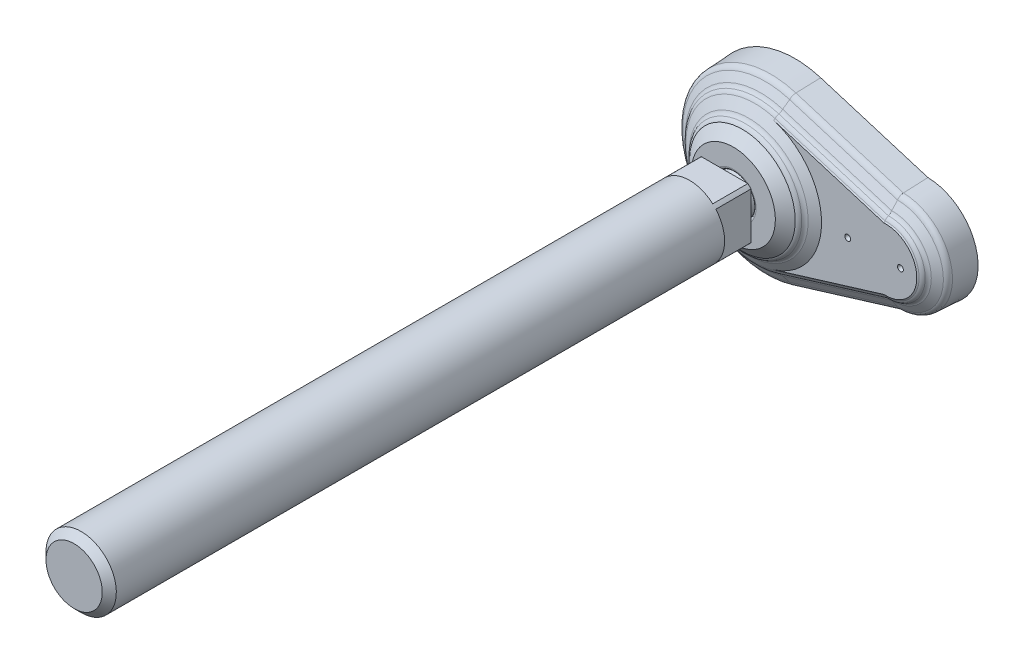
ISO-10303-21;
HEADER;
FILE_DESCRIPTION(('STEP AP214'),'2;1');
FILE_NAME('part.step','',(''),(''),'','','');
FILE_SCHEMA(('AUTOMOTIVE_DESIGN { 1 0 10303 214 1 1 1 1 }'));
ENDSEC;
DATA;
#1=APPLICATION_CONTEXT('core data for automotive mechanical design processes');
#2=APPLICATION_PROTOCOL_DEFINITION('international standard','automotive_design',2000,#1);
#3=PRODUCT_CONTEXT('',#1,'mechanical');
#4=PRODUCT('Part','Part','',(#3));
#5=PRODUCT_RELATED_PRODUCT_CATEGORY('part','',(#4));
#6=PRODUCT_DEFINITION_FORMATION('','',#4);
#7=PRODUCT_DEFINITION_CONTEXT('part definition',#1,'design');
#8=PRODUCT_DEFINITION('design','',#6,#7);
#9=PRODUCT_DEFINITION_SHAPE('','',#8);
#10=(LENGTH_UNIT() NAMED_UNIT(*) SI_UNIT(.MILLI.,.METRE.));
#11=(NAMED_UNIT(*) PLANE_ANGLE_UNIT() SI_UNIT($,.RADIAN.));
#12=(NAMED_UNIT(*) SI_UNIT($,.STERADIAN.) SOLID_ANGLE_UNIT());
#13=UNCERTAINTY_MEASURE_WITH_UNIT(LENGTH_MEASURE(1.E-05),#10,'distance_accuracy_value','');
#14=(GEOMETRIC_REPRESENTATION_CONTEXT(3) GLOBAL_UNCERTAINTY_ASSIGNED_CONTEXT((#13)) GLOBAL_UNIT_ASSIGNED_CONTEXT((#10,
#11,#12)) REPRESENTATION_CONTEXT('',''));
#15=CARTESIAN_POINT('',(0.,0.,0.));
#16=DIRECTION('',(0.,0.,1.));
#17=DIRECTION('',(1.,0.,0.));
#18=AXIS2_PLACEMENT_3D('',#15,#16,#17);
#19=CARTESIAN_POINT('',(0.,0.,38.));
#20=DIRECTION('',(0.,0.,1.));
#21=DIRECTION('',(-1.,0.,0.));
#22=AXIS2_PLACEMENT_3D('',#19,#20,#21);
#23=CYLINDRICAL_SURFACE('',#22,12.);
#24=CARTESIAN_POINT('',(0.,0.,245.6));
#25=DIRECTION('',(0.,0.,1.));
#26=DIRECTION('',(-1.,0.,0.));
#27=AXIS2_PLACEMENT_3D('',#24,#25,#26);
#28=CIRCLE('',#27,12.);
#29=CARTESIAN_POINT('',(-12.,0.,245.6));
#30=VERTEX_POINT('',#29);
#31=EDGE_CURVE('E9',#30,#30,#28,.F.);
#32=ORIENTED_EDGE('',*,*,#31,.T.);
#33=EDGE_LOOP('',(#32));
#34=FACE_BOUND('',#33,.T.);
#35=DIRECTION('',(0.,0.,1.));
#36=VECTOR('',#35,1.);
#37=CARTESIAN_POINT('',(-7.93725393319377,-9.,38.));
#38=LINE('',#37,#36);
#39=CARTESIAN_POINT('',(-7.93725393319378,-9.,38.));
#40=VERTEX_POINT('',#39);
#41=CARTESIAN_POINT('',(-7.93725393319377,-9.,26.));
#42=VERTEX_POINT('',#41);
#43=EDGE_CURVE('E159',#40,#42,#38,.F.);
#44=ORIENTED_EDGE('',*,*,#43,.F.);
#45=CARTESIAN_POINT('',(0.,0.,38.));
#46=DIRECTION('',(0.,0.,1.));
#47=DIRECTION('',(0.,-1.,0.));
#48=AXIS2_PLACEMENT_3D('',#45,#46,#47);
#49=CIRCLE('',#48,12.);
#50=CARTESIAN_POINT('',(7.93725393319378,-9.,38.));
#51=VERTEX_POINT('',#50);
#52=EDGE_CURVE('E1164',#40,#51,#49,.T.);
#53=ORIENTED_EDGE('',*,*,#52,.T.);
#54=DIRECTION('',(0.,0.,1.));
#55=VECTOR('',#54,1.);
#56=CARTESIAN_POINT('',(7.93725393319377,-9.,38.));
#57=LINE('',#56,#55);
#58=CARTESIAN_POINT('',(7.93725393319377,-9.,26.));
#59=VERTEX_POINT('',#58);
#60=EDGE_CURVE('E224',#59,#51,#57,.T.);
#61=ORIENTED_EDGE('',*,*,#60,.F.);
#62=CARTESIAN_POINT('',(0.,0.,26.));
#63=DIRECTION('',(0.,0.,1.));
#64=DIRECTION('',(-1.,0.,0.));
#65=AXIS2_PLACEMENT_3D('',#62,#63,#64);
#66=CIRCLE('',#65,12.);
#67=CARTESIAN_POINT('',(9.,-7.93725393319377,26.));
#68=VERTEX_POINT('',#67);
#69=EDGE_CURVE('E207',#59,#68,#66,.T.);
#70=ORIENTED_EDGE('',*,*,#69,.T.);
#71=DIRECTION('',(0.,0.,1.));
#72=VECTOR('',#71,1.);
#73=CARTESIAN_POINT('',(9.,-7.93725393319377,38.));
#74=LINE('',#73,#72);
#75=CARTESIAN_POINT('',(9.,-7.93725393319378,38.));
#76=VERTEX_POINT('',#75);
#77=EDGE_CURVE('E221',#76,#68,#74,.F.);
#78=ORIENTED_EDGE('',*,*,#77,.F.);
#79=CARTESIAN_POINT('',(9.,7.93725393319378,38.));
#80=VERTEX_POINT('',#79);
#81=EDGE_CURVE('E301',#76,#80,#49,.T.);
#82=ORIENTED_EDGE('',*,*,#81,.T.);
#83=DIRECTION('',(0.,0.,1.));
#84=VECTOR('',#83,1.);
#85=CARTESIAN_POINT('',(9.,7.93725393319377,38.));
#86=LINE('',#85,#84);
#87=CARTESIAN_POINT('',(9.,7.93725393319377,26.));
#88=VERTEX_POINT('',#87);
#89=EDGE_CURVE('E266',#88,#80,#86,.T.);
#90=ORIENTED_EDGE('',*,*,#89,.F.);
#91=CARTESIAN_POINT('',(7.93725393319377,9.,26.));
#92=VERTEX_POINT('',#91);
#93=EDGE_CURVE('E203',#88,#92,#66,.T.);
#94=ORIENTED_EDGE('',*,*,#93,.T.);
#95=DIRECTION('',(0.,0.,1.));
#96=VECTOR('',#95,1.);
#97=CARTESIAN_POINT('',(7.93725393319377,9.,38.));
#98=LINE('',#97,#96);
#99=CARTESIAN_POINT('',(7.93725393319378,9.,38.));
#100=VERTEX_POINT('',#99);
#101=EDGE_CURVE('E184',#100,#92,#98,.F.);
#102=ORIENTED_EDGE('',*,*,#101,.F.);
#103=CARTESIAN_POINT('',(-7.93725393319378,9.,38.));
#104=VERTEX_POINT('',#103);
#105=EDGE_CURVE('E197',#100,#104,#49,.T.);
#106=ORIENTED_EDGE('',*,*,#105,.T.);
#107=DIRECTION('',(0.,0.,1.));
#108=VECTOR('',#107,1.);
#109=CARTESIAN_POINT('',(-7.93725393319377,9.,38.));
#110=LINE('',#109,#108);
#111=CARTESIAN_POINT('',(-7.93725393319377,9.,26.));
#112=VERTEX_POINT('',#111);
#113=EDGE_CURVE('E182',#112,#104,#110,.T.);
#114=ORIENTED_EDGE('',*,*,#113,.F.);
#115=CARTESIAN_POINT('',(-9.,7.93725393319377,26.));
#116=VERTEX_POINT('',#115);
#117=EDGE_CURVE('E195',#112,#116,#66,.T.);
#118=ORIENTED_EDGE('',*,*,#117,.T.);
#119=DIRECTION('',(0.,0.,1.));
#120=VECTOR('',#119,1.);
#121=CARTESIAN_POINT('',(-9.,7.93725393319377,38.));
#122=LINE('',#121,#120);
#123=CARTESIAN_POINT('',(-9.,7.93725393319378,38.));
#124=VERTEX_POINT('',#123);
#125=EDGE_CURVE('E198',#124,#116,#122,.F.);
#126=ORIENTED_EDGE('',*,*,#125,.F.);
#127=CARTESIAN_POINT('',(-9.,-7.93725393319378,38.));
#128=VERTEX_POINT('',#127);
#129=EDGE_CURVE('E1166',#124,#128,#49,.T.);
#130=ORIENTED_EDGE('',*,*,#129,.T.);
#131=DIRECTION('',(0.,0.,1.));
#132=VECTOR('',#131,1.);
#133=CARTESIAN_POINT('',(-9.,-7.93725393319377,38.));
#134=LINE('',#133,#132);
#135=CARTESIAN_POINT('',(-9.,-7.93725393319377,26.));
#136=VERTEX_POINT('',#135);
#137=EDGE_CURVE('E204',#136,#128,#134,.T.);
#138=ORIENTED_EDGE('',*,*,#137,.F.);
#139=EDGE_CURVE('E206',#136,#42,#66,.T.);
#140=ORIENTED_EDGE('',*,*,#139,.T.);
#141=EDGE_LOOP('',(#44,#53,#61,#70,#78,#82,#90,#94,#102,#106,#114,#118,#126,#130,#138,#140));
#142=FACE_BOUND('',#141,.T.);
#143=ADVANCED_FACE('F15',(#34,#142),#23,.T.);
#144=CARTESIAN_POINT('',(-5.24903501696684,0.,26.));
#145=DIRECTION('',(0.,0.,1.));
#146=DIRECTION('',(-1.,0.,0.));
#147=AXIS2_PLACEMENT_3D('',#144,#145,#146);
#148=PLANE('',#147);
#149=DIRECTION('',(0.,-1.,0.));
#150=VECTOR('',#149,1.);
#151=CARTESIAN_POINT('',(-9.,9.,26.));
#152=LINE('',#151,#150);
#153=EDGE_CURVE('E32',#116,#136,#152,.T.);
#154=ORIENTED_EDGE('',*,*,#153,.F.);
#155=ORIENTED_EDGE('',*,*,#117,.F.);
#156=DIRECTION('',(-1.,0.,0.));
#157=VECTOR('',#156,1.);
#158=CARTESIAN_POINT('',(9.,9.,26.));
#159=LINE('',#158,#157);
#160=EDGE_CURVE('E177',#92,#112,#159,.T.);
#161=ORIENTED_EDGE('',*,*,#160,.F.);
#162=ORIENTED_EDGE('',*,*,#93,.F.);
#163=DIRECTION('',(0.,1.,0.));
#164=VECTOR('',#163,1.);
#165=CARTESIAN_POINT('',(9.,-9.,26.));
#166=LINE('',#165,#164);
#167=EDGE_CURVE('E189',#68,#88,#166,.T.);
#168=ORIENTED_EDGE('',*,*,#167,.F.);
#169=ORIENTED_EDGE('',*,*,#69,.F.);
#170=DIRECTION('',(1.,0.,0.));
#171=VECTOR('',#170,1.);
#172=CARTESIAN_POINT('',(-9.,-9.,26.));
#173=LINE('',#172,#171);
#174=EDGE_CURVE('E226',#42,#59,#173,.T.);
#175=ORIENTED_EDGE('',*,*,#174,.F.);
#176=ORIENTED_EDGE('',*,*,#139,.F.);
#177=EDGE_LOOP('',(#154,#155,#161,#162,#168,#169,#175,#176));
#178=FACE_BOUND('',#177,.T.);
#179=CARTESIAN_POINT('',(0.,0.,26.));
#180=DIRECTION('',(0.,0.,1.));
#181=DIRECTION('',(-1.,0.,0.));
#182=AXIS2_PLACEMENT_3D('',#179,#180,#181);
#183=CIRCLE('',#182,5.24903501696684);
#184=CARTESIAN_POINT('',(-5.24903501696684,0.,26.));
#185=VERTEX_POINT('',#184);
#186=EDGE_CURVE('E212',#185,#185,#183,.T.);
#187=ORIENTED_EDGE('',*,*,#186,.T.);
#188=EDGE_LOOP('',(#187));
#189=FACE_BOUND('',#188,.T.);
#190=ADVANCED_FACE('F200',(#178,#189),#148,.F.);
#191=CARTESIAN_POINT('',(0.,0.,19.6309999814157));
#192=DIRECTION('',(0.,0.,1.));
#193=DIRECTION('',(-1.,0.,0.));
#194=AXIS2_PLACEMENT_3D('',#191,#192,#193);
#195=DEGENERATE_TOROIDAL_SURFACE('',#194,0.0005038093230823,6.829,.T.);
#196=CARTESIAN_POINT('',(0.,0.,20.775));
#197=DIRECTION('',(0.,0.,-1.));
#198=DIRECTION('',(1.,0.,0.));
#199=AXIS2_PLACEMENT_3D('',#196,#197,#198);
#200=CIRCLE('',#199,6.733);
#201=CARTESIAN_POINT('',(6.733,0.,20.775));
#202=VERTEX_POINT('',#201);
#203=EDGE_CURVE('E273',#202,#202,#200,.T.);
#204=ORIENTED_EDGE('',*,*,#203,.F.);
#205=EDGE_LOOP('',(#204));
#206=FACE_BOUND('',#205,.T.);
#207=CARTESIAN_POINT('',(0.,0.,24.));
#208=DIRECTION('',(0.,0.,1.));
#209=DIRECTION('',(-1.,0.,0.));
#210=AXIS2_PLACEMENT_3D('',#207,#208,#209);
#211=CIRCLE('',#210,5.24903501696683);
#212=CARTESIAN_POINT('',(-5.24903501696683,0.,24.));
#213=VERTEX_POINT('',#212);
#214=EDGE_CURVE('E214',#213,#213,#211,.T.);
#215=ORIENTED_EDGE('',*,*,#214,.F.);
#216=EDGE_LOOP('',(#215));
#217=FACE_BOUND('',#216,.T.);
#218=ADVANCED_FACE('F533',(#206,#217),#195,.T.);
#219=CARTESIAN_POINT('',(0.,0.,38.));
#220=DIRECTION('',(0.,0.,1.));
#221=DIRECTION('',(-1.,0.,0.));
#222=AXIS2_PLACEMENT_3D('',#219,#220,#221);
#223=CYLINDRICAL_SURFACE('',#222,5.24903501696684);
#224=ORIENTED_EDGE('',*,*,#186,.F.);
#225=EDGE_LOOP('',(#224));
#226=FACE_BOUND('',#225,.T.);
#227=ORIENTED_EDGE('',*,*,#214,.T.);
#228=EDGE_LOOP('',(#227));
#229=FACE_BOUND('',#228,.T.);
#230=ADVANCED_FACE('F1117',(#226,#229),#223,.T.);
#231=CARTESIAN_POINT('',(-9.,-9.,26.));
#232=DIRECTION('',(0.,-1.,0.));
#233=DIRECTION('',(1.,0.,0.));
#234=AXIS2_PLACEMENT_3D('',#231,#232,#233);
#235=PLANE('',#234);
#236=ORIENTED_EDGE('',*,*,#60,.T.);
#237=DIRECTION('',(-1.,0.,0.));
#238=VECTOR('',#237,1.);
#239=CARTESIAN_POINT('',(-12.,-9.,38.));
#240=LINE('',#239,#238);
#241=EDGE_CURVE('E238',#51,#40,#240,.T.);
#242=ORIENTED_EDGE('',*,*,#241,.T.);
#243=ORIENTED_EDGE('',*,*,#43,.T.);
#244=ORIENTED_EDGE('',*,*,#174,.T.);
#245=EDGE_LOOP('',(#236,#242,#243,#244));
#246=FACE_BOUND('',#245,.T.);
#247=ADVANCED_FACE('F1109',(#246),#235,.T.);
#248=CARTESIAN_POINT('',(9.,-9.,26.));
#249=DIRECTION('',(1.,0.,0.));
#250=DIRECTION('',(0.,1.,0.));
#251=AXIS2_PLACEMENT_3D('',#248,#249,#250);
#252=PLANE('',#251);
#253=ORIENTED_EDGE('',*,*,#89,.T.);
#254=DIRECTION('',(0.,-1.,0.));
#255=VECTOR('',#254,1.);
#256=CARTESIAN_POINT('',(9.,0.,38.));
#257=LINE('',#256,#255);
#258=EDGE_CURVE('E245',#80,#76,#257,.T.);
#259=ORIENTED_EDGE('',*,*,#258,.T.);
#260=ORIENTED_EDGE('',*,*,#77,.T.);
#261=ORIENTED_EDGE('',*,*,#167,.T.);
#262=EDGE_LOOP('',(#253,#259,#260,#261));
#263=FACE_BOUND('',#262,.T.);
#264=ADVANCED_FACE('F1101',(#263),#252,.T.);
#265=CARTESIAN_POINT('',(9.,9.,26.));
#266=DIRECTION('',(0.,1.,0.));
#267=DIRECTION('',(-1.,0.,0.));
#268=AXIS2_PLACEMENT_3D('',#265,#266,#267);
#269=PLANE('',#268);
#270=ORIENTED_EDGE('',*,*,#113,.T.);
#271=DIRECTION('',(1.,0.,0.));
#272=VECTOR('',#271,1.);
#273=CARTESIAN_POINT('',(-12.,9.,38.));
#274=LINE('',#273,#272);
#275=EDGE_CURVE('E249',#104,#100,#274,.T.);
#276=ORIENTED_EDGE('',*,*,#275,.T.);
#277=ORIENTED_EDGE('',*,*,#101,.T.);
#278=ORIENTED_EDGE('',*,*,#160,.T.);
#279=EDGE_LOOP('',(#270,#276,#277,#278));
#280=FACE_BOUND('',#279,.T.);
#281=ADVANCED_FACE('F179',(#280),#269,.T.);
#282=CARTESIAN_POINT('',(-9.,9.,26.));
#283=DIRECTION('',(-1.,0.,0.));
#284=DIRECTION('',(0.,-1.,0.));
#285=AXIS2_PLACEMENT_3D('',#282,#283,#284);
#286=PLANE('',#285);
#287=ORIENTED_EDGE('',*,*,#137,.T.);
#288=DIRECTION('',(0.,1.,0.));
#289=VECTOR('',#288,1.);
#290=CARTESIAN_POINT('',(-9.,0.,38.));
#291=LINE('',#290,#289);
#292=EDGE_CURVE('E262',#128,#124,#291,.T.);
#293=ORIENTED_EDGE('',*,*,#292,.T.);
#294=ORIENTED_EDGE('',*,*,#125,.T.);
#295=ORIENTED_EDGE('',*,*,#153,.T.);
#296=EDGE_LOOP('',(#287,#293,#294,#295));
#297=FACE_BOUND('',#296,.T.);
#298=ADVANCED_FACE('F873',(#297),#286,.T.);
#299=CARTESIAN_POINT('',(0.,0.,0.));
#300=DIRECTION('',(0.,0.,1.));
#301=DIRECTION('',(0.,-1.,0.));
#302=AXIS2_PLACEMENT_3D('',#299,#300,#301);
#303=PLANE('',#302);
#304=DIRECTION('',(-0.950373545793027,0.311111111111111,0.));
#305=VECTOR('',#304,1.);
#306=CARTESIAN_POINT('',(48.7333333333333,11.4044825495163,0.));
#307=LINE('',#306,#305);
#308=CARTESIAN_POINT('',(48.7333333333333,11.4044825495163,0.));
#309=VERTEX_POINT('',#308);
#310=CARTESIAN_POINT('',(8.08888888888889,24.7097121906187,0.));
#311=VERTEX_POINT('',#310);
#312=EDGE_CURVE('E285',#309,#311,#307,.T.);
#313=ORIENTED_EDGE('',*,*,#312,.F.);
#314=CARTESIAN_POINT('',(45.,0.,0.));
#315=DIRECTION('',(0.,0.,1.));
#316=DIRECTION('',(1.,0.,0.));
#317=AXIS2_PLACEMENT_3D('',#314,#315,#316);
#318=CIRCLE('',#317,12.);
#319=CARTESIAN_POINT('',(48.7333333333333,-11.4044825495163,0.));
#320=VERTEX_POINT('',#319);
#321=EDGE_CURVE('E295',#320,#309,#318,.T.);
#322=ORIENTED_EDGE('',*,*,#321,.F.);
#323=DIRECTION('',(0.950373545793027,0.311111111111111,0.));
#324=VECTOR('',#323,1.);
#325=CARTESIAN_POINT('',(8.08888888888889,-24.7097121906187,0.));
#326=LINE('',#325,#324);
#327=CARTESIAN_POINT('',(8.08888888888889,-24.7097121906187,0.));
#328=VERTEX_POINT('',#327);
#329=EDGE_CURVE('E292',#328,#320,#326,.T.);
#330=ORIENTED_EDGE('',*,*,#329,.F.);
#331=CARTESIAN_POINT('',(0.,0.,0.));
#332=DIRECTION('',(0.,0.,1.));
#333=DIRECTION('',(1.,0.,0.));
#334=AXIS2_PLACEMENT_3D('',#331,#332,#333);
#335=CIRCLE('',#334,26.);
#336=EDGE_CURVE('E288',#311,#328,#335,.T.);
#337=ORIENTED_EDGE('',*,*,#336,.F.);
#338=EDGE_LOOP('',(#313,#322,#330,#337));
#339=FACE_BOUND('',#338,.T.);
#340=ADVANCED_FACE('F535',(#339),#303,.F.);
#341=CARTESIAN_POINT('',(8.08888888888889,-24.7097121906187,0.));
#342=DIRECTION('',(0.311111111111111,-0.950373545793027,0.));
#343=DIRECTION('',(0.950373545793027,0.311111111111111,0.));
#344=AXIS2_PLACEMENT_3D('',#341,#342,#343);
#345=PLANE('',#344);
#346=DIRECTION('',(0.950373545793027,0.311111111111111,0.));
#347=VECTOR('',#346,1.);
#348=CARTESIAN_POINT('',(8.08888888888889,-24.7097121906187,2.));
#349=LINE('',#348,#347);
#350=CARTESIAN_POINT('',(8.08888888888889,-24.7097121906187,2.));
#351=VERTEX_POINT('',#350);
#352=CARTESIAN_POINT('',(48.7333333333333,-11.4044825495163,2.));
#353=VERTEX_POINT('',#352);
#354=EDGE_CURVE('E304',#351,#353,#349,.T.);
#355=ORIENTED_EDGE('',*,*,#354,.F.);
#356=DIRECTION('',(0.,0.,1.));
#357=VECTOR('',#356,1.);
#358=CARTESIAN_POINT('',(8.08888888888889,-24.7097121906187,0.));
#359=LINE('',#358,#357);
#360=EDGE_CURVE('E312',#328,#351,#359,.T.);
#361=ORIENTED_EDGE('',*,*,#360,.F.);
#362=ORIENTED_EDGE('',*,*,#329,.T.);
#363=DIRECTION('',(0.,0.,1.));
#364=VECTOR('',#363,1.);
#365=CARTESIAN_POINT('',(48.7333333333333,-11.4044825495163,0.));
#366=LINE('',#365,#364);
#367=EDGE_CURVE('E310',#320,#353,#366,.T.);
#368=ORIENTED_EDGE('',*,*,#367,.T.);
#369=EDGE_LOOP('',(#355,#361,#362,#368));
#370=FACE_BOUND('',#369,.T.);
#371=ADVANCED_FACE('F1056',(#370),#345,.T.);
#372=CARTESIAN_POINT('',(0.,0.,0.));
#373=DIRECTION('',(0.,0.,1.));
#374=DIRECTION('',(0.,-1.,0.));
#375=AXIS2_PLACEMENT_3D('',#372,#373,#374);
#376=CYLINDRICAL_SURFACE('',#375,26.);
#377=CARTESIAN_POINT('',(0.,0.,2.));
#378=DIRECTION('',(0.,0.,1.));
#379=DIRECTION('',(1.,0.,0.));
#380=AXIS2_PLACEMENT_3D('',#377,#378,#379);
#381=CIRCLE('',#380,26.);
#382=CARTESIAN_POINT('',(8.08888888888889,24.7097121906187,2.));
#383=VERTEX_POINT('',#382);
#384=EDGE_CURVE('E300',#383,#351,#381,.T.);
#385=ORIENTED_EDGE('',*,*,#384,.F.);
#386=DIRECTION('',(0.,0.,1.));
#387=VECTOR('',#386,1.);
#388=CARTESIAN_POINT('',(8.08888888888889,24.7097121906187,0.));
#389=LINE('',#388,#387);
#390=EDGE_CURVE('E314',#311,#383,#389,.T.);
#391=ORIENTED_EDGE('',*,*,#390,.F.);
#392=ORIENTED_EDGE('',*,*,#336,.T.);
#393=ORIENTED_EDGE('',*,*,#360,.T.);
#394=EDGE_LOOP('',(#385,#391,#392,#393));
#395=FACE_BOUND('',#394,.T.);
#396=ADVANCED_FACE('F1063',(#395),#376,.T.);
#397=CARTESIAN_POINT('',(48.7333333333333,11.4044825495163,0.));
#398=DIRECTION('',(0.311111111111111,0.950373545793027,0.));
#399=DIRECTION('',(-0.950373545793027,0.311111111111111,0.));
#400=AXIS2_PLACEMENT_3D('',#397,#398,#399);
#401=PLANE('',#400);
#402=DIRECTION('',(-0.950373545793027,0.311111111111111,0.));
#403=VECTOR('',#402,1.);
#404=CARTESIAN_POINT('',(48.7333333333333,11.4044825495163,2.));
#405=LINE('',#404,#403);
#406=CARTESIAN_POINT('',(48.7333333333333,11.4044825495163,2.));
#407=VERTEX_POINT('',#406);
#408=EDGE_CURVE('E150',#407,#383,#405,.T.);
#409=ORIENTED_EDGE('',*,*,#408,.F.);
#410=DIRECTION('',(0.,0.,1.));
#411=VECTOR('',#410,1.);
#412=CARTESIAN_POINT('',(48.7333333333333,11.4044825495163,0.));
#413=LINE('',#412,#411);
#414=EDGE_CURVE('E298',#309,#407,#413,.T.);
#415=ORIENTED_EDGE('',*,*,#414,.F.);
#416=ORIENTED_EDGE('',*,*,#312,.T.);
#417=ORIENTED_EDGE('',*,*,#390,.T.);
#418=EDGE_LOOP('',(#409,#415,#416,#417));
#419=FACE_BOUND('',#418,.T.);
#420=ADVANCED_FACE('F557',(#419),#401,.T.);
#421=CARTESIAN_POINT('',(45.,0.,0.));
#422=DIRECTION('',(0.,0.,1.));
#423=DIRECTION('',(0.,-1.,0.));
#424=AXIS2_PLACEMENT_3D('',#421,#422,#423);
#425=CYLINDRICAL_SURFACE('',#424,12.);
#426=CARTESIAN_POINT('',(45.,0.,2.));
#427=DIRECTION('',(0.,0.,1.));
#428=DIRECTION('',(1.,0.,0.));
#429=AXIS2_PLACEMENT_3D('',#426,#427,#428);
#430=CIRCLE('',#429,12.);
#431=EDGE_CURVE('E289',#353,#407,#430,.T.);
#432=ORIENTED_EDGE('',*,*,#431,.F.);
#433=ORIENTED_EDGE('',*,*,#367,.F.);
#434=ORIENTED_EDGE('',*,*,#321,.T.);
#435=ORIENTED_EDGE('',*,*,#414,.T.);
#436=EDGE_LOOP('',(#432,#433,#434,#435));
#437=FACE_BOUND('',#436,.T.);
#438=ADVANCED_FACE('F543',(#437),#425,.T.);
#439=CARTESIAN_POINT('',(45.,0.,2.));
#440=DIRECTION('',(0.,0.,-1.));
#441=DIRECTION('',(0.,1.,0.));
#442=AXIS2_PLACEMENT_3D('',#439,#440,#441);
#443=CONICAL_SURFACE('',#442,17.5,0.0523365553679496);
#444=CARTESIAN_POINT('',(45.,0.,10.304));
#445=DIRECTION('',(0.,0.,1.));
#446=DIRECTION('',(0.,-1.,0.));
#447=AXIS2_PLACEMENT_3D('',#444,#445,#446);
#448=CIRCLE('',#447,17.065);
#449=CARTESIAN_POINT('',(45.3136024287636,-17.0621182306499,10.304));
#450=VERTEX_POINT('',#449);
#451=CARTESIAN_POINT('',(45.3136024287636,17.0621182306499,10.304));
#452=VERTEX_POINT('',#451);
#453=EDGE_CURVE('E363',#450,#452,#448,.T.);
#454=ORIENTED_EDGE('',*,*,#453,.F.);
#455=CARTESIAN_POINT('',(45.3136007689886,-17.0621077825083,10.3042));
#456=CARTESIAN_POINT('',(45.3250873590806,-17.134412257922,8.92013380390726));
#457=CARTESIAN_POINT('',(45.3366049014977,-17.206707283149,7.5360673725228));
#458=CARTESIAN_POINT('',(45.3597018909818,-17.3512784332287,4.76793403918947));
#459=CARTESIAN_POINT('',(45.3712813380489,-17.4235545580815,3.38386713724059));
#460=CARTESIAN_POINT('',(45.3828917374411,-17.4958212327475,1.9998));
#461=B_SPLINE_CURVE_WITH_KNOTS('',3,(#455,#456,#457,#458,#459,#460),.UNSPECIFIED.,.F.,.F.,(4,2,
4),(0.,4.15800336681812,8.31600673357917),.UNSPECIFIED.);
#462=CARTESIAN_POINT('',(45.3828900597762,-17.4958107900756,2.));
#463=VERTEX_POINT('',#462);
#464=EDGE_CURVE('E669',#450,#463,#461,.T.);
#465=ORIENTED_EDGE('',*,*,#464,.T.);
#466=CARTESIAN_POINT('',(45.,0.,2.));
#467=DIRECTION('',(0.,0.,1.));
#468=DIRECTION('',(0.,-1.,0.));
#469=AXIS2_PLACEMENT_3D('',#466,#467,#468);
#470=CIRCLE('',#469,17.5);
#471=CARTESIAN_POINT('',(45.3828900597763,17.4958107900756,2.));
#472=VERTEX_POINT('',#471);
#473=EDGE_CURVE('E366',#463,#472,#470,.T.);
#474=ORIENTED_EDGE('',*,*,#473,.T.);
#475=CARTESIAN_POINT('',(45.3828917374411,17.4958212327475,1.9998));
#476=CARTESIAN_POINT('',(45.371281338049,17.4235545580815,3.38386713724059));
#477=CARTESIAN_POINT('',(45.359701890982,17.3512784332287,4.76793403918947));
#478=CARTESIAN_POINT('',(45.3366049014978,17.206707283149,7.5360673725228));
#479=CARTESIAN_POINT('',(45.3250873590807,17.134412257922,8.92013380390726));
#480=CARTESIAN_POINT('',(45.3136007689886,17.0621077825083,10.3042));
#481=B_SPLINE_CURVE_WITH_KNOTS('',3,(#475,#476,#477,#478,#479,#480),.UNSPECIFIED.,.F.,.F.,(4,2,
4),(0.,4.15800336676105,8.31600673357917),.UNSPECIFIED.);
#482=EDGE_CURVE('E685',#472,#452,#481,.T.);
#483=ORIENTED_EDGE('',*,*,#482,.T.);
#484=EDGE_LOOP('',(#454,#465,#474,#483));
#485=FACE_BOUND('',#484,.T.);
#486=ADVANCED_FACE('F423',(#485),#443,.T.);
#487=CARTESIAN_POINT('',(46.8961596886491,-16.5782819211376,10.304));
#488=DIRECTION('',(-0.291971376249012,0.9549953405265,-0.0523126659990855));
#489=DIRECTION('',(-0.956304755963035,-0.292371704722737,0.));
#490=AXIS2_PLACEMENT_3D('',#487,#488,#489);
#491=PLANE('',#490);
#492=ORIENTED_EDGE('',*,*,#464,.F.);
#493=DIRECTION('',(-0.956304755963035,-0.292371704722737,0.));
#494=VECTOR('',#493,1.);
#495=CARTESIAN_POINT('',(46.8961596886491,-16.5782819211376,10.304));
#496=LINE('',#495,#494);
#497=CARTESIAN_POINT('',(8.64396945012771,-28.2731501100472,10.304));
#498=VERTEX_POINT('',#497);
#499=EDGE_CURVE('E617',#450,#498,#496,.T.);
#500=ORIENTED_EDGE('',*,*,#499,.T.);
#501=DIRECTION('',(-0.0152947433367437,0.050026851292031,0.998630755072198));
#502=VECTOR('',#501,1.);
#503=CARTESIAN_POINT('',(8.7711511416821,-28.689142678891,2.));
#504=LINE('',#503,#502);
#505=CARTESIAN_POINT('',(8.7711511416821,-28.689142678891,2.));
#506=VERTEX_POINT('',#505);
#507=EDGE_CURVE('E623',#506,#498,#504,.T.);
#508=ORIENTED_EDGE('',*,*,#507,.F.);
#509=DIRECTION('',(-0.956304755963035,-0.292371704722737,0.));
#510=VECTOR('',#509,1.);
#511=CARTESIAN_POINT('',(47.0233413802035,-16.9942744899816,2.));
#512=LINE('',#511,#510);
#513=EDGE_CURVE('E144',#463,#506,#512,.T.);
#514=ORIENTED_EDGE('',*,*,#513,.F.);
#515=EDGE_LOOP('',(#492,#500,#508,#514));
#516=FACE_BOUND('',#515,.T.);
#517=ADVANCED_FACE('F529',(#516),#491,.F.);
#518=CARTESIAN_POINT('',(0.,0.,2.));
#519=DIRECTION('',(0.,0.,1.));
#520=DIRECTION('',(0.,-1.,0.));
#521=AXIS2_PLACEMENT_3D('',#518,#519,#520);
#522=PLANE('',#521);
#523=ORIENTED_EDGE('',*,*,#431,.T.);
#524=ORIENTED_EDGE('',*,*,#408,.T.);
#525=ORIENTED_EDGE('',*,*,#384,.T.);
#526=ORIENTED_EDGE('',*,*,#354,.T.);
#527=EDGE_LOOP('',(#523,#524,#525,#526));
#528=FACE_BOUND('',#527,.T.);
#529=DIRECTION('',(-0.956304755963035,0.292371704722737,0.));
#530=VECTOR('',#529,1.);
#531=CARTESIAN_POINT('',(47.0233413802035,16.9942744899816,2.));
#532=LINE('',#531,#530);
#533=CARTESIAN_POINT('',(8.7711511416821,28.689142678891,2.));
#534=VERTEX_POINT('',#533);
#535=EDGE_CURVE('E672',#472,#534,#532,.T.);
#536=ORIENTED_EDGE('',*,*,#535,.F.);
#537=ORIENTED_EDGE('',*,*,#473,.F.);
#538=ORIENTED_EDGE('',*,*,#513,.T.);
#539=CARTESIAN_POINT('',(0.,0.,2.));
#540=DIRECTION('',(0.,0.,1.));
#541=DIRECTION('',(0.,-1.,0.));
#542=AXIS2_PLACEMENT_3D('',#539,#540,#541);
#543=CIRCLE('',#542,30.);
#544=EDGE_CURVE('E412',#534,#506,#543,.T.);
#545=ORIENTED_EDGE('',*,*,#544,.F.);
#546=EDGE_LOOP('',(#536,#537,#538,#545));
#547=FACE_BOUND('',#546,.T.);
#548=ADVANCED_FACE('F421',(#528,#547),#522,.F.);
#549=CARTESIAN_POINT('',(47.0233413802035,16.9942744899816,2.));
#550=DIRECTION('',(-0.291971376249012,-0.9549953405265,-0.0523126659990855));
#551=DIRECTION('',(0.956304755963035,-0.292371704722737,0.));
#552=AXIS2_PLACEMENT_3D('',#549,#550,#551);
#553=PLANE('',#552);
#554=ORIENTED_EDGE('',*,*,#482,.F.);
#555=ORIENTED_EDGE('',*,*,#535,.T.);
#556=DIRECTION('',(-0.0152947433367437,-0.050026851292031,0.998630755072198));
#557=VECTOR('',#556,1.);
#558=CARTESIAN_POINT('',(8.7711511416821,28.689142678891,2.));
#559=LINE('',#558,#557);
#560=CARTESIAN_POINT('',(8.64396945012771,28.2731501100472,10.304));
#561=VERTEX_POINT('',#560);
#562=EDGE_CURVE('E637',#534,#561,#559,.T.);
#563=ORIENTED_EDGE('',*,*,#562,.T.);
#564=DIRECTION('',(-0.956304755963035,0.292371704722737,0.));
#565=VECTOR('',#564,1.);
#566=CARTESIAN_POINT('',(46.8961596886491,16.5782819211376,10.304));
#567=LINE('',#566,#565);
#568=EDGE_CURVE('E673',#452,#561,#567,.T.);
#569=ORIENTED_EDGE('',*,*,#568,.F.);
#570=EDGE_LOOP('',(#554,#555,#563,#569));
#571=FACE_BOUND('',#570,.T.);
#572=ADVANCED_FACE('F499',(#571),#553,.F.);
#573=CARTESIAN_POINT('',(45.,0.,10.2086896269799));
#574=DIRECTION('',(0.,0.,1.));
#575=DIRECTION('',(0.,-1.,0.));
#576=AXIS2_PLACEMENT_3D('',#573,#574,#575);
#577=TOROIDAL_SURFACE('',#576,15.0672723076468,2.);
#578=CARTESIAN_POINT('',(45.313603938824,-17.062127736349,10.3038));
#579=CARTESIAN_POINT('',(45.3131828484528,-17.0594763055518,10.3596419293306));
#580=CARTESIAN_POINT('',(45.3123906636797,-17.0544900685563,10.4153431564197));
#581=CARTESIAN_POINT('',(45.3100724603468,-17.0398916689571,10.5261166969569));
#582=CARTESIAN_POINT('',(45.3085464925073,-17.0302798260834,10.5811890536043));
#583=CARTESIAN_POINT('',(45.3028875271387,-16.9946160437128,10.7447437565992));
#584=CARTESIAN_POINT('',(45.2976717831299,-16.9617253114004,10.8517806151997));
#585=CARTESIAN_POINT('',(45.284530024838,-16.8786837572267,11.0587251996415));
#586=CARTESIAN_POINT('',(45.2766032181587,-16.8285278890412,11.1586308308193));
#587=CARTESIAN_POINT('',(45.2583029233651,-16.7124179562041,11.348570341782));
#588=CARTESIAN_POINT('',(45.24792931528,-16.6464631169,11.4386037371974));
#589=CARTESIAN_POINT('',(45.2250216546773,-16.5003240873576,11.6067133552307));
#590=CARTESIAN_POINT('',(45.2124772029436,-16.4200713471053,11.684728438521));
#591=CARTESIAN_POINT('',(45.1856662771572,-16.2478592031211,11.8261370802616));
#592=CARTESIAN_POINT('',(45.1714009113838,-16.1559073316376,11.8895399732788));
#593=CARTESIAN_POINT('',(45.148748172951,-16.0092275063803,11.9735680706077));
#594=CARTESIAN_POINT('',(45.1408156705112,-15.957749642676,12.0001426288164));
#595=CARTESIAN_POINT('',(45.1246863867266,-15.8528232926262,12.0486569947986));
#596=CARTESIAN_POINT('',(45.1164901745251,-15.7993790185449,12.0706061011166));
#597=CARTESIAN_POINT('',(45.1081834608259,-15.7450737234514,12.0902));
#598=B_SPLINE_CURVE_WITH_KNOTS('',3,(#578,#579,#580,#581,#582,#583,#584,#585,#586,#587,#588,
#589,#590,#591,#592,#593,#594,#595,#596,#597),.UNSPECIFIED.,.F.,.F.,(4,2,2,2,2,2,2,2,2,4),(0.,
0.167615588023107,0.335219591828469,0.669784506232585,1.00444729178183,1.33912648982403,
1.67545571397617,2.01156948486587,2.1867983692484,2.36167155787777),.UNSPECIFIED.);
#599=CARTESIAN_POINT('',(45.108268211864,-15.7456277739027,12.09));
#600=VERTEX_POINT('',#599);
#601=EDGE_CURVE('E691',#450,#600,#598,.T.);
#602=ORIENTED_EDGE('',*,*,#601,.F.);
#603=ORIENTED_EDGE('',*,*,#453,.T.);
#604=CARTESIAN_POINT('',(45.1081834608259,15.7450737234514,12.0902));
#605=CARTESIAN_POINT('',(45.1162755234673,15.7979756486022,12.0711117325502));
#606=CARTESIAN_POINT('',(45.1242625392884,15.8500594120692,12.0497900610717));
#607=CARTESIAN_POINT('',(45.1399729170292,15.9522733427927,12.0028085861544));
#608=CARTESIAN_POINT('',(45.1476962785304,16.0024035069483,11.9771487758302));
#609=CARTESIAN_POINT('',(45.170371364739,16.1492634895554,11.8939254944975));
#610=CARTESIAN_POINT('',(45.1848488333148,16.2425982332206,11.8300692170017));
#611=CARTESIAN_POINT('',(45.2120467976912,16.4173167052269,11.6873614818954));
#612=CARTESIAN_POINT('',(45.2247661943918,16.4986929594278,11.6085007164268));
#613=CARTESIAN_POINT('',(45.2480269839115,16.647087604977,11.4379734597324));
#614=CARTESIAN_POINT('',(45.2585686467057,16.7141077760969,11.3463085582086));
#615=CARTESIAN_POINT('',(45.2770522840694,16.8313730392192,11.1534556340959));
#616=CARTESIAN_POINT('',(45.2850114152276,16.8817288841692,11.0523364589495));
#617=CARTESIAN_POINT('',(45.298151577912,16.9647535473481,10.8429463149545));
#618=CARTESIAN_POINT('',(45.3033350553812,16.9974379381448,10.7346817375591));
#619=CARTESIAN_POINT('',(45.3088197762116,17.0320013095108,10.5716792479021));
#620=CARTESIAN_POINT('',(45.3102579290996,17.0410597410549,10.5184099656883));
#621=CARTESIAN_POINT('',(45.3124461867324,17.0548396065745,10.411403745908));
#622=CARTESIAN_POINT('',(45.3131976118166,17.0595693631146,10.3576679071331));
#623=CARTESIAN_POINT('',(45.313603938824,17.062127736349,10.3038));
#624=B_SPLINE_CURVE_WITH_KNOTS('',3,(#604,#605,#606,#607,#608,#609,#610,#611,#612,#613,#614,
#615,#616,#617,#618,#619,#620,#621,#622,#623),.UNSPECIFIED.,.F.,.F.,(4,2,2,2,2,2,2,2,2,4),(0.,
0.170355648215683,0.340711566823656,0.680992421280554,1.02148505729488,1.36193545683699,
1.70007548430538,2.03791704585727,2.19992239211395,2.36161559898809),.UNSPECIFIED.);
#625=CARTESIAN_POINT('',(45.1082682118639,15.7456277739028,12.09));
#626=VERTEX_POINT('',#625);
#627=EDGE_CURVE('E488',#626,#452,#624,.T.);
#628=ORIENTED_EDGE('',*,*,#627,.F.);
#629=CARTESIAN_POINT('',(45.,0.,12.09));
#630=DIRECTION('',(0.,0.,1.));
#631=DIRECTION('',(0.,-1.,0.));
#632=AXIS2_PLACEMENT_3D('',#629,#630,#631);
#633=CIRCLE('',#632,15.746);
#634=EDGE_CURVE('E360',#600,#626,#633,.T.);
#635=ORIENTED_EDGE('',*,*,#634,.F.);
#636=EDGE_LOOP('',(#602,#603,#628,#635));
#637=FACE_BOUND('',#636,.T.);
#638=ADVANCED_FACE('F472',(#637),#577,.T.);
#639=CARTESIAN_POINT('',(46.312080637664,-14.6678454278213,10.2086896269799));
#640=DIRECTION('',(-0.956304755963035,-0.292371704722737,0.));
#641=DIRECTION('',(0.292371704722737,-0.956304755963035,0.));
#642=AXIS2_PLACEMENT_3D('',#639,#640,#641);
#643=CYLINDRICAL_SURFACE('',#642,2.);
#644=ORIENTED_EDGE('',*,*,#499,.F.);
#645=ORIENTED_EDGE('',*,*,#601,.T.);
#646=DIRECTION('',(-0.956304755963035,-0.292371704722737,0.));
#647=VECTOR('',#646,1.);
#648=CARTESIAN_POINT('',(46.5105214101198,-15.3169159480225,12.09));
#649=LINE('',#648,#647);
#650=CARTESIAN_POINT('',(8.25833117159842,-27.0117841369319,12.09));
#651=VERTEX_POINT('',#650);
#652=EDGE_CURVE('E614',#600,#651,#649,.T.);
#653=ORIENTED_EDGE('',*,*,#652,.T.);
#654=CARTESIAN_POINT('',(8.05989039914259,-26.3627136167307,10.2086896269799));
#655=DIRECTION('',(0.956304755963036,0.292371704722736,0.));
#656=DIRECTION('',(-0.292371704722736,0.956304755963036,0.));
#657=AXIS2_PLACEMENT_3D('',#654,#655,#656);
#658=CIRCLE('',#657,2.);
#659=EDGE_CURVE('E626',#651,#498,#658,.T.);
#660=ORIENTED_EDGE('',*,*,#659,.T.);
#661=EDGE_LOOP('',(#644,#645,#653,#660));
#662=FACE_BOUND('',#661,.T.);
#663=ADVANCED_FACE('F500',(#662),#643,.T.);
#664=CARTESIAN_POINT('',(0.,0.,2.));
#665=DIRECTION('',(0.,0.,-1.));
#666=DIRECTION('',(0.,1.,0.));
#667=AXIS2_PLACEMENT_3D('',#664,#665,#666);
#668=CONICAL_SURFACE('',#667,30.,0.0523365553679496);
#669=CARTESIAN_POINT('',(0.,0.,10.304));
#670=DIRECTION('',(0.,0.,1.));
#671=DIRECTION('',(0.,-1.,0.));
#672=AXIS2_PLACEMENT_3D('',#669,#670,#671);
#673=CIRCLE('',#672,29.565);
#674=EDGE_CURVE('E657',#561,#498,#673,.T.);
#675=ORIENTED_EDGE('',*,*,#674,.F.);
#676=ORIENTED_EDGE('',*,*,#562,.F.);
#677=ORIENTED_EDGE('',*,*,#544,.T.);
#678=ORIENTED_EDGE('',*,*,#507,.T.);
#679=EDGE_LOOP('',(#675,#676,#677,#678));
#680=FACE_BOUND('',#679,.T.);
#681=ADVANCED_FACE('F520',(#680),#668,.T.);
#682=CARTESIAN_POINT('',(46.312080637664,14.6678454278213,10.2086896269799));
#683=DIRECTION('',(-0.956304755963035,0.292371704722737,0.));
#684=DIRECTION('',(-0.292371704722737,-0.956304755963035,0.));
#685=AXIS2_PLACEMENT_3D('',#682,#683,#684);
#686=CYLINDRICAL_SURFACE('',#685,2.);
#687=DIRECTION('',(-0.956304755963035,0.292371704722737,0.));
#688=VECTOR('',#687,1.);
#689=CARTESIAN_POINT('',(46.5105214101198,15.3169159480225,12.09));
#690=LINE('',#689,#688);
#691=CARTESIAN_POINT('',(8.25833117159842,27.0117841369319,12.09));
#692=VERTEX_POINT('',#691);
#693=EDGE_CURVE('E603',#626,#692,#690,.T.);
#694=ORIENTED_EDGE('',*,*,#693,.F.);
#695=ORIENTED_EDGE('',*,*,#627,.T.);
#696=ORIENTED_EDGE('',*,*,#568,.T.);
#697=CARTESIAN_POINT('',(8.05989039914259,26.3627136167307,10.2086896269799));
#698=DIRECTION('',(-0.956304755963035,0.292371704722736,0.));
#699=DIRECTION('',(-0.292371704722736,-0.956304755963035,0.));
#700=AXIS2_PLACEMENT_3D('',#697,#698,#699);
#701=CIRCLE('',#700,2.);
#702=EDGE_CURVE('E640',#692,#561,#701,.T.);
#703=ORIENTED_EDGE('',*,*,#702,.F.);
#704=EDGE_LOOP('',(#694,#695,#696,#703));
#705=FACE_BOUND('',#704,.T.);
#706=ADVANCED_FACE('F431',(#705),#686,.T.);
#707=CARTESIAN_POINT('',(45.,0.,12.09));
#708=DIRECTION('',(0.,0.,-1.));
#709=DIRECTION('',(0.,1.,0.));
#710=AXIS2_PLACEMENT_3D('',#707,#708,#709);
#711=CONICAL_SURFACE('',#710,15.746,0.993858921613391);
#712=CARTESIAN_POINT('',(45.,0.,13.7170000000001));
#713=DIRECTION('',(0.,0.,1.));
#714=DIRECTION('',(0.,-1.,0.));
#715=AXIS2_PLACEMENT_3D('',#712,#713,#714);
#716=CIRCLE('',#715,13.2459999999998);
#717=CARTESIAN_POINT('',(44.7416637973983,-13.243480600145,13.7170000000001));
#718=VERTEX_POINT('',#717);
#719=CARTESIAN_POINT('',(44.7416637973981,13.2434806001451,13.7170000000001));
#720=VERTEX_POINT('',#719);
#721=EDGE_CURVE('E358',#718,#720,#716,.T.);
#722=ORIENTED_EDGE('',*,*,#721,.F.);
#723=CARTESIAN_POINT('',(44.7416208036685,-13.2431723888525,13.7172000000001));
#724=CARTESIAN_POINT('',(44.8000092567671,-13.66082442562,13.4461588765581));
#725=CARTESIAN_POINT('',(44.8597613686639,-14.078214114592,13.1750215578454));
#726=CARTESIAN_POINT('',(44.9819928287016,-14.9124682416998,12.6325548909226));
#727=CARTESIAN_POINT('',(45.0444721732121,-15.3293326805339,12.3612255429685));
#728=CARTESIAN_POINT('',(45.1083151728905,-15.745934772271,12.0898));
#729=B_SPLINE_CURVE_WITH_KNOTS('',3,(#723,#724,#725,#726,#727,#728),.UNSPECIFIED.,.F.,.F.,(4,2,
4),(0.,1.50389468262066,3.0077873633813),.UNSPECIFIED.);
#730=EDGE_CURVE('E481',#718,#600,#729,.T.);
#731=ORIENTED_EDGE('',*,*,#730,.T.);
#732=ORIENTED_EDGE('',*,*,#634,.T.);
#733=CARTESIAN_POINT('',(45.1083151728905,15.745934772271,12.0898));
#734=CARTESIAN_POINT('',(45.0444721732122,15.3293326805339,12.3612255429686));
#735=CARTESIAN_POINT('',(44.9819928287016,14.9124682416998,12.6325548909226));
#736=CARTESIAN_POINT('',(44.8597613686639,14.078214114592,13.1750215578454));
#737=CARTESIAN_POINT('',(44.8000092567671,13.66082442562,13.4461588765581));
#738=CARTESIAN_POINT('',(44.7416208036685,13.2431723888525,13.7172000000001));
#739=B_SPLINE_CURVE_WITH_KNOTS('',3,(#733,#734,#735,#736,#737,#738),.UNSPECIFIED.,.F.,.F.,(4,2,
4),(0.,1.50389268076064,3.0077873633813),.UNSPECIFIED.);
#740=EDGE_CURVE('E475',#626,#720,#739,.T.);
#741=ORIENTED_EDGE('',*,*,#740,.T.);
#742=EDGE_LOOP('',(#722,#731,#732,#741));
#743=FACE_BOUND('',#742,.T.);
#744=ADVANCED_FACE('F466',(#743),#711,.T.);
#745=CARTESIAN_POINT('',(45.7795921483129,-12.9261540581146,13.7170000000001));
#746=DIRECTION('',(-0.159476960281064,0.521625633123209,-0.838137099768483));
#747=DIRECTION('',(0.,0.849002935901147,0.528388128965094));
#748=AXIS2_PLACEMENT_3D('',#745,#746,#747);
#749=PLANE('',#748);
#750=ORIENTED_EDGE('',*,*,#730,.F.);
#751=DIRECTION('',(-0.956304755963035,-0.292371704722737,0.));
#752=VECTOR('',#751,1.);
#753=CARTESIAN_POINT('',(45.7795921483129,-12.9261540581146,13.7170000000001));
#754=LINE('',#753,#752);
#755=CARTESIAN_POINT('',(7.52740190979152,-24.6210222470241,13.7170000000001));
#756=VERTEX_POINT('',#755);
#757=EDGE_CURVE('E609',#718,#756,#754,.T.);
#758=ORIENTED_EDGE('',*,*,#757,.T.);
#759=DIRECTION('',(-0.245047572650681,0.801514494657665,0.545459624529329));
#760=VECTOR('',#759,1.);
#761=CARTESIAN_POINT('',(8.25833117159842,-27.0117841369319,12.09));
#762=LINE('',#761,#760);
#763=EDGE_CURVE('E629',#651,#756,#762,.T.);
#764=ORIENTED_EDGE('',*,*,#763,.F.);
#765=ORIENTED_EDGE('',*,*,#652,.F.);
#766=EDGE_LOOP('',(#750,#758,#764,#765));
#767=FACE_BOUND('',#766,.T.);
#768=ADVANCED_FACE('F470',(#767),#749,.F.);
#769=CARTESIAN_POINT('',(0.,0.,10.2086896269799));
#770=DIRECTION('',(0.,0.,1.));
#771=DIRECTION('',(0.,-1.,0.));
#772=AXIS2_PLACEMENT_3D('',#769,#770,#771);
#773=TOROIDAL_SURFACE('',#772,27.5672723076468,2.);
#774=CARTESIAN_POINT('',(0.,0.,12.09));
#775=DIRECTION('',(0.,0.,1.));
#776=DIRECTION('',(0.,-1.,0.));
#777=AXIS2_PLACEMENT_3D('',#774,#775,#776);
#778=CIRCLE('',#777,28.246);
#779=EDGE_CURVE('E655',#692,#651,#778,.T.);
#780=ORIENTED_EDGE('',*,*,#779,.F.);
#781=ORIENTED_EDGE('',*,*,#702,.T.);
#782=ORIENTED_EDGE('',*,*,#674,.T.);
#783=ORIENTED_EDGE('',*,*,#659,.F.);
#784=EDGE_LOOP('',(#780,#781,#782,#783));
#785=FACE_BOUND('',#784,.T.);
#786=ADVANCED_FACE('F497',(#785),#773,.T.);
#787=CARTESIAN_POINT('',(46.5105214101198,15.3169159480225,12.09));
#788=DIRECTION('',(-0.159476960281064,-0.521625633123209,-0.838137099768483));
#789=DIRECTION('',(0.,0.849002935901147,-0.528388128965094));
#790=AXIS2_PLACEMENT_3D('',#787,#788,#789);
#791=PLANE('',#790);
#792=ORIENTED_EDGE('',*,*,#740,.F.);
#793=ORIENTED_EDGE('',*,*,#693,.T.);
#794=DIRECTION('',(-0.245047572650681,-0.801514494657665,0.545459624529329));
#795=VECTOR('',#794,1.);
#796=CARTESIAN_POINT('',(8.25833117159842,27.0117841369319,12.09));
#797=LINE('',#796,#795);
#798=CARTESIAN_POINT('',(7.52740190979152,24.6210222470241,13.7170000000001));
#799=VERTEX_POINT('',#798);
#800=EDGE_CURVE('E602',#692,#799,#797,.T.);
#801=ORIENTED_EDGE('',*,*,#800,.T.);
#802=DIRECTION('',(-0.956304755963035,0.292371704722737,0.));
#803=VECTOR('',#802,1.);
#804=CARTESIAN_POINT('',(45.7795921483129,12.9261540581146,13.7170000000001));
#805=LINE('',#804,#803);
#806=EDGE_CURVE('E595',#720,#799,#805,.T.);
#807=ORIENTED_EDGE('',*,*,#806,.F.);
#808=EDGE_LOOP('',(#792,#793,#801,#807));
#809=FACE_BOUND('',#808,.T.);
#810=ADVANCED_FACE('F437',(#809),#791,.F.);
#811=CARTESIAN_POINT('',(45.,0.,15.5975547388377));
#812=DIRECTION('',(0.,0.,1.));
#813=DIRECTION('',(0.,-1.,0.));
#814=AXIS2_PLACEMENT_3D('',#811,#812,#813);
#815=TOROIDAL_SURFACE('',#814,13.9471154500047,2.007);
#816=CARTESIAN_POINT('',(44.7417388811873,-13.2440188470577,13.7168000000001));
#817=CARTESIAN_POINT('',(44.7343279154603,-13.1908941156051,13.7365326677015));
#818=CARTESIAN_POINT('',(44.7270601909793,-13.1386083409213,13.7584983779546));
#819=CARTESIAN_POINT('',(44.7128498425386,-13.0360296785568,13.8067671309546));
#820=CARTESIAN_POINT('',(44.7059072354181,-12.9857368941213,13.8330703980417));
#821=CARTESIAN_POINT('',(44.6856140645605,-12.8382408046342,13.9183407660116));
#822=CARTESIAN_POINT('',(44.6728115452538,-12.7445159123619,13.9836326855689));
#823=CARTESIAN_POINT('',(44.6490134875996,-12.5692567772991,14.129233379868));
#824=CARTESIAN_POINT('',(44.6380196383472,-12.487733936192,14.2095560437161));
#825=CARTESIAN_POINT('',(44.6181322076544,-12.3395119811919,14.3828602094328));
#826=CARTESIAN_POINT('',(44.6092328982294,-12.2727724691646,14.4758060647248));
#827=CARTESIAN_POINT('',(44.5998238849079,-12.2019312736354,14.5946409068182));
#828=CARTESIAN_POINT('',(44.5982145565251,-12.1898023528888,14.6158623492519));
#829=CARTESIAN_POINT('',(44.5951037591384,-12.166336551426,14.6587196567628));
#830=CARTESIAN_POINT('',(44.5936021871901,-12.1549989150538,14.6803551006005));
#831=CARTESIAN_POINT('',(44.5921537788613,-12.1440536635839,14.7021999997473));
#832=B_SPLINE_CURVE_WITH_KNOTS('',3,(#816,#817,#818,#819,#820,#821,#822,#823,#824,#825,#826,
#827,#828,#829,#830,#831),.UNSPECIFIED.,.F.,.F.,(4,2,2,2,2,2,2,4),(0.,0.171355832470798,
0.34272053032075,0.685756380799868,1.02911079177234,1.37151502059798,1.44499468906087,
1.51840319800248),.UNSPECIFIED.);
#833=CARTESIAN_POINT('',(44.5921670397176,-12.1441538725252,14.7019999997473));
#834=VERTEX_POINT('',#833);
#835=EDGE_CURVE('E448',#718,#834,#832,.T.);
#836=ORIENTED_EDGE('',*,*,#835,.F.);
#837=ORIENTED_EDGE('',*,*,#721,.T.);
#838=CARTESIAN_POINT('',(44.5921537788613,12.1440536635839,14.7021999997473));
#839=CARTESIAN_POINT('',(44.5955092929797,12.1694097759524,14.6515877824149));
#840=CARTESIAN_POINT('',(44.599152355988,12.1968896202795,14.602091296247));
#841=CARTESIAN_POINT('',(44.6069951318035,12.2559024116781,14.5056278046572));
#842=CARTESIAN_POINT('',(44.6111948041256,12.2874350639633,14.4586606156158));
#843=CARTESIAN_POINT('',(44.6245996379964,12.3878100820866,14.3220118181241));
#844=CARTESIAN_POINT('',(44.6346123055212,12.4624423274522,14.2365574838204));
#845=CARTESIAN_POINT('',(44.6565336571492,12.6247734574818,14.0794943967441));
#846=CARTESIAN_POINT('',(44.6684429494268,12.712476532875,14.0078901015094));
#847=CARTESIAN_POINT('',(44.6938576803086,12.8983236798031,13.8805096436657));
#848=CARTESIAN_POINT('',(44.7073595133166,12.9964441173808,13.8246986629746));
#849=CARTESIAN_POINT('',(44.7247880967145,13.122192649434,13.7664352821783));
#850=CARTESIAN_POINT('',(44.728135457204,13.1463053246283,13.7558334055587));
#851=CARTESIAN_POINT('',(44.7348911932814,13.1948908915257,13.7355957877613));
#852=CARTESIAN_POINT('',(44.7382994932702,13.2193633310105,13.7259589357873));
#853=CARTESIAN_POINT('',(44.7417388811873,13.2440188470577,13.7168000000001));
#854=B_SPLINE_CURVE_WITH_KNOTS('',3,(#838,#839,#840,#841,#842,#843,#844,#845,#846,#847,#848,
#849,#850,#851,#852,#853),.UNSPECIFIED.,.F.,.F.,(4,2,2,2,2,2,2,4),(0.,0.170014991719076,
0.340017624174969,0.679938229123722,1.01996805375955,1.35924229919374,1.43888856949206,
1.51844208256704),.UNSPECIFIED.);
#855=CARTESIAN_POINT('',(44.5921670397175,12.1441538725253,14.7019999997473));
#856=VERTEX_POINT('',#855);
#857=EDGE_CURVE('E441',#856,#720,#854,.T.);
#858=ORIENTED_EDGE('',*,*,#857,.F.);
#859=CARTESIAN_POINT('',(45.,0.,14.7019999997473));
#860=DIRECTION('',(0.,0.,1.));
#861=DIRECTION('',(0.,-1.,0.));
#862=AXIS2_PLACEMENT_3D('',#859,#860,#861);
#863=CIRCLE('',#862,12.1510000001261);
#864=EDGE_CURVE('E356',#834,#856,#863,.T.);
#865=ORIENTED_EDGE('',*,*,#864,.F.);
#866=EDGE_LOOP('',(#836,#837,#858,#865));
#867=FACE_BOUND('',#866,.T.);
#868=ADVANCED_FACE('F460',(#867),#815,.F.);
#869=CARTESIAN_POINT('',(45.9845784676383,-13.5966340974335,15.5975547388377));
#870=DIRECTION('',(-0.956304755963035,-0.292371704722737,0.));
#871=DIRECTION('',(0.292371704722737,-0.956304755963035,0.));
#872=AXIS2_PLACEMENT_3D('',#869,#870,#871);
#873=CYLINDRICAL_SURFACE('',#872,2.007);
#874=ORIENTED_EDGE('',*,*,#757,.F.);
#875=ORIENTED_EDGE('',*,*,#835,.T.);
#876=DIRECTION('',(-0.956304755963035,-0.292371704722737,0.));
#877=VECTOR('',#876,1.);
#878=CARTESIAN_POINT('',(45.4594451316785,-11.8790003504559,14.7019999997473));
#879=LINE('',#878,#877);
#880=CARTESIAN_POINT('',(7.20725489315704,-23.5738685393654,14.7019999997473));
#881=VERTEX_POINT('',#880);
#882=EDGE_CURVE('E589',#834,#881,#879,.T.);
#883=ORIENTED_EDGE('',*,*,#882,.T.);
#884=CARTESIAN_POINT('',(7.7323882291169,-25.291502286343,15.5975547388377));
#885=DIRECTION('',(0.956304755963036,0.292371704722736,0.));
#886=DIRECTION('',(-0.292371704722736,0.956304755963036,0.));
#887=AXIS2_PLACEMENT_3D('',#884,#885,#886);
#888=CIRCLE('',#887,2.007);
#889=EDGE_CURVE('E611',#756,#881,#888,.T.);
#890=ORIENTED_EDGE('',*,*,#889,.F.);
#891=EDGE_LOOP('',(#874,#875,#883,#890));
#892=FACE_BOUND('',#891,.T.);
#893=ADVANCED_FACE('F464',(#892),#873,.F.);
#894=CARTESIAN_POINT('',(0.,0.,12.09));
#895=DIRECTION('',(0.,0.,-1.));
#896=DIRECTION('',(0.,1.,0.));
#897=AXIS2_PLACEMENT_3D('',#894,#895,#896);
#898=CONICAL_SURFACE('',#897,28.246,0.993858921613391);
#899=CARTESIAN_POINT('',(0.,0.,13.7170000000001));
#900=DIRECTION('',(0.,0.,1.));
#901=DIRECTION('',(0.,-1.,0.));
#902=AXIS2_PLACEMENT_3D('',#899,#900,#901);
#903=CIRCLE('',#902,25.746);
#904=EDGE_CURVE('E653',#799,#756,#903,.T.);
#905=ORIENTED_EDGE('',*,*,#904,.F.);
#906=ORIENTED_EDGE('',*,*,#800,.F.);
#907=ORIENTED_EDGE('',*,*,#779,.T.);
#908=ORIENTED_EDGE('',*,*,#763,.T.);
#909=EDGE_LOOP('',(#905,#906,#907,#908));
#910=FACE_BOUND('',#909,.T.);
#911=ADVANCED_FACE('F435',(#910),#898,.T.);
#912=CARTESIAN_POINT('',(45.9845784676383,13.5966340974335,15.5975547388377));
#913=DIRECTION('',(-0.956304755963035,0.292371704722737,0.));
#914=DIRECTION('',(-0.292371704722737,-0.956304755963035,0.));
#915=AXIS2_PLACEMENT_3D('',#912,#913,#914);
#916=CYLINDRICAL_SURFACE('',#915,2.007);
#917=DIRECTION('',(-0.956304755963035,0.292371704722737,0.));
#918=VECTOR('',#917,1.);
#919=CARTESIAN_POINT('',(45.4594451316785,11.8790003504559,14.7019999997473));
#920=LINE('',#919,#918);
#921=CARTESIAN_POINT('',(7.20725489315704,23.5738685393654,14.7019999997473));
#922=VERTEX_POINT('',#921);
#923=EDGE_CURVE('E583',#856,#922,#920,.T.);
#924=ORIENTED_EDGE('',*,*,#923,.F.);
#925=ORIENTED_EDGE('',*,*,#857,.T.);
#926=ORIENTED_EDGE('',*,*,#806,.T.);
#927=CARTESIAN_POINT('',(7.7323882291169,25.291502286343,15.5975547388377));
#928=DIRECTION('',(-0.956304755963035,0.292371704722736,0.));
#929=DIRECTION('',(-0.292371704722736,-0.956304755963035,0.));
#930=AXIS2_PLACEMENT_3D('',#927,#928,#929);
#931=CIRCLE('',#930,2.007);
#932=EDGE_CURVE('E644',#799,#922,#931,.T.);
#933=ORIENTED_EDGE('',*,*,#932,.T.);
#934=EDGE_LOOP('',(#924,#925,#926,#933));
#935=FACE_BOUND('',#934,.T.);
#936=ADVANCED_FACE('F422',(#935),#916,.F.);
#937=CARTESIAN_POINT('',(45.,0.,13.8059878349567));
#938=DIRECTION('',(0.,0.,1.));
#939=DIRECTION('',(0.,-1.,0.));
#940=AXIS2_PLACEMENT_3D('',#937,#938,#939);
#941=TOROIDAL_SURFACE('',#940,10.3551126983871,2.007);
#942=CARTESIAN_POINT('',(44.5921803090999,-12.1442541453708,14.7017999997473));
#943=CARTESIAN_POINT('',(44.5888264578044,-12.1189091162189,14.7523579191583));
#944=CARTESIAN_POINT('',(44.5851980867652,-12.0914410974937,14.8018007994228));
#945=CARTESIAN_POINT('',(44.5774254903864,-12.0324505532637,14.8981580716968));
#946=CARTESIAN_POINT('',(44.5732813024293,-12.0009283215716,14.9450726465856));
#947=CARTESIAN_POINT('',(44.5601271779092,-11.900585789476,15.0815540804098));
#948=CARTESIAN_POINT('',(44.5503931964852,-11.8259709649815,15.166895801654));
#949=CARTESIAN_POINT('',(44.5293734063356,-11.6636453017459,15.3237420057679));
#950=CARTESIAN_POINT('',(44.5180870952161,-11.5759302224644,15.3952419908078));
#951=CARTESIAN_POINT('',(44.4943743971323,-11.3900195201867,15.5224423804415));
#952=CARTESIAN_POINT('',(44.4819505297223,-11.2918469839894,15.5781766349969));
#953=CARTESIAN_POINT('',(44.4661159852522,-11.1654767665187,15.6366284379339));
#954=CARTESIAN_POINT('',(44.4630317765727,-11.1408064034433,15.6474450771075));
#955=CARTESIAN_POINT('',(44.4568308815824,-11.0910877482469,15.668072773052));
#956=CARTESIAN_POINT('',(44.4537142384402,-11.0660399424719,15.6778850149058));
#957=CARTESIAN_POINT('',(44.4505813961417,-11.0408004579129,15.6872));
#958=B_SPLINE_CURVE_WITH_KNOTS('',3,(#942,#943,#944,#945,#946,#947,#948,#949,#950,#951,#952,
#953,#954,#955,#956,#957),.UNSPECIFIED.,.F.,.F.,(4,2,2,2,2,2,2,4),(0.,0.169854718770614,
0.339697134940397,0.679258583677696,1.01893018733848,1.35786686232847,1.43919562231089,
1.52042728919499),.UNSPECIFIED.);
#959=CARTESIAN_POINT('',(44.4506486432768,-11.0413422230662,15.687));
#960=VERTEX_POINT('',#959);
#961=EDGE_CURVE('E449',#834,#960,#958,.T.);
#962=ORIENTED_EDGE('',*,*,#961,.F.);
#963=ORIENTED_EDGE('',*,*,#864,.T.);
#964=CARTESIAN_POINT('',(44.4505813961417,11.0408004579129,15.6872));
#965=CARTESIAN_POINT('',(44.4571923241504,11.0940621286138,15.6675450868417));
#966=CARTESIAN_POINT('',(44.4637328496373,11.1464811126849,15.64566148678));
#967=CARTESIAN_POINT('',(44.4766250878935,11.2493192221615,15.5975597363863));
#968=CARTESIAN_POINT('',(44.4829767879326,11.2997382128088,15.5713412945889));
#969=CARTESIAN_POINT('',(44.5016867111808,11.4476029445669,15.4863205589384));
#970=CARTESIAN_POINT('',(44.5136874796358,11.5415577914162,15.421189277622));
#971=CARTESIAN_POINT('',(44.5362881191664,11.7172436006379,15.2758674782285));
#972=CARTESIAN_POINT('',(44.5468865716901,11.798962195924,15.1956619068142));
#973=CARTESIAN_POINT('',(44.5662631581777,11.9475320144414,15.0225496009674));
#974=CARTESIAN_POINT('',(44.5750462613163,12.0144238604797,14.929678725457));
#975=CARTESIAN_POINT('',(44.5844278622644,12.0855850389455,14.8106563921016));
#976=CARTESIAN_POINT('',(44.586051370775,12.0978868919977,14.7891835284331));
#977=CARTESIAN_POINT('',(44.5891939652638,12.1216776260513,14.7458118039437));
#978=CARTESIAN_POINT('',(44.5907131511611,12.1331672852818,14.7239133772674));
#979=CARTESIAN_POINT('',(44.5921803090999,12.1442541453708,14.7017999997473));
#980=B_SPLINE_CURVE_WITH_KNOTS('',3,(#964,#965,#966,#967,#968,#969,#970,#971,#972,#973,#974,
#975,#976,#977,#978,#979),.UNSPECIFIED.,.F.,.F.,(4,2,2,2,2,2,2,4),(0.,0.171364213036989,
0.342739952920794,0.68580508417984,1.02921464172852,1.37167135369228,1.44606372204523,
1.52038381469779),.UNSPECIFIED.);
#981=CARTESIAN_POINT('',(44.4506486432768,11.0413422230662,15.687));
#982=VERTEX_POINT('',#981);
#983=EDGE_CURVE('E378',#982,#856,#980,.T.);
#984=ORIENTED_EDGE('',*,*,#983,.F.);
#985=CARTESIAN_POINT('',(45.,0.,15.687));
#986=DIRECTION('',(0.,0.,1.));
#987=DIRECTION('',(0.,-1.,0.));
#988=AXIS2_PLACEMENT_3D('',#985,#986,#987);
#989=CIRCLE('',#988,11.0549999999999);
#990=EDGE_CURVE('E354',#960,#982,#989,.T.);
#991=ORIENTED_EDGE('',*,*,#990,.F.);
#992=EDGE_LOOP('',(#962,#963,#984,#991));
#993=FACE_BOUND('',#992,.T.);
#994=ADVANCED_FACE('F398',(#993),#941,.T.);
#995=CARTESIAN_POINT('',(44.9343784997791,-10.1615847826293,13.8059878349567));
#996=DIRECTION('',(-0.956304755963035,-0.292371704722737,0.));
#997=DIRECTION('',(0.292371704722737,-0.956304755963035,0.));
#998=AXIS2_PLACEMENT_3D('',#995,#996,#997);
#999=CYLINDRICAL_SURFACE('',#998,2.00700000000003);
#1000=ORIENTED_EDGE('',*,*,#882,.F.);
#1001=ORIENTED_EDGE('',*,*,#961,.T.);
#1002=DIRECTION('',(-0.956304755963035,-0.292371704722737,0.));
#1003=VECTOR('',#1002,1.);
#1004=CARTESIAN_POINT('',(45.1390057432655,-10.8308903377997,15.687));
#1005=LINE('',#1004,#1003);
#1006=CARTESIAN_POINT('',(6.88681550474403,-22.5257585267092,15.687));
#1007=VERTEX_POINT('',#1006);
#1008=EDGE_CURVE('E564',#960,#1007,#1005,.T.);
#1009=ORIENTED_EDGE('',*,*,#1008,.T.);
#1010=CARTESIAN_POINT('',(6.6821882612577,-21.8564529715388,13.8059878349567));
#1011=DIRECTION('',(0.956304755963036,0.292371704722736,0.));
#1012=DIRECTION('',(-0.292371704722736,0.956304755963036,0.));
#1013=AXIS2_PLACEMENT_3D('',#1010,#1011,#1012);
#1014=CIRCLE('',#1013,2.00700000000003);
#1015=EDGE_CURVE('E633',#1007,#881,#1014,.T.);
#1016=ORIENTED_EDGE('',*,*,#1015,.T.);
#1017=EDGE_LOOP('',(#1000,#1001,#1009,#1016));
#1018=FACE_BOUND('',#1017,.T.);
#1019=ADVANCED_FACE('F506',(#1018),#999,.T.);
#1020=CARTESIAN_POINT('',(0.,0.,15.5975547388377));
#1021=DIRECTION('',(0.,0.,1.));
#1022=DIRECTION('',(0.,-1.,0.));
#1023=AXIS2_PLACEMENT_3D('',#1020,#1021,#1022);
#1024=TOROIDAL_SURFACE('',#1023,26.4471154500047,2.007);
#1025=CARTESIAN_POINT('',(0.,0.,14.7019999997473));
#1026=DIRECTION('',(0.,0.,1.));
#1027=DIRECTION('',(0.,-1.,0.));
#1028=AXIS2_PLACEMENT_3D('',#1025,#1026,#1027);
#1029=CIRCLE('',#1028,24.651000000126);
#1030=EDGE_CURVE('E651',#922,#881,#1029,.T.);
#1031=ORIENTED_EDGE('',*,*,#1030,.F.);
#1032=ORIENTED_EDGE('',*,*,#932,.F.);
#1033=ORIENTED_EDGE('',*,*,#904,.T.);
#1034=ORIENTED_EDGE('',*,*,#889,.T.);
#1035=EDGE_LOOP('',(#1031,#1032,#1033,#1034));
#1036=FACE_BOUND('',#1035,.T.);
#1037=ADVANCED_FACE('F429',(#1036),#1024,.F.);
#1038=CARTESIAN_POINT('',(44.9343784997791,10.1615847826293,13.8059878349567));
#1039=DIRECTION('',(-0.956304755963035,0.292371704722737,0.));
#1040=DIRECTION('',(-0.292371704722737,-0.956304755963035,0.));
#1041=AXIS2_PLACEMENT_3D('',#1038,#1039,#1040);
#1042=CYLINDRICAL_SURFACE('',#1041,2.00700000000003);
#1043=DIRECTION('',(-0.956304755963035,0.292371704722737,0.));
#1044=VECTOR('',#1043,1.);
#1045=CARTESIAN_POINT('',(45.1390057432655,10.8308903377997,15.687));
#1046=LINE('',#1045,#1044);
#1047=CARTESIAN_POINT('',(6.88681550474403,22.5257585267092,15.687));
#1048=VERTEX_POINT('',#1047);
#1049=EDGE_CURVE('E574',#982,#1048,#1046,.T.);
#1050=ORIENTED_EDGE('',*,*,#1049,.F.);
#1051=ORIENTED_EDGE('',*,*,#983,.T.);
#1052=ORIENTED_EDGE('',*,*,#923,.T.);
#1053=CARTESIAN_POINT('',(6.6821882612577,21.8564529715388,13.8059878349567));
#1054=DIRECTION('',(-0.956304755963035,0.292371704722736,0.));
#1055=DIRECTION('',(-0.292371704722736,-0.956304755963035,0.));
#1056=AXIS2_PLACEMENT_3D('',#1053,#1054,#1055);
#1057=CIRCLE('',#1056,2.00700000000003);
#1058=EDGE_CURVE('E582',#1048,#922,#1057,.T.);
#1059=ORIENTED_EDGE('',*,*,#1058,.F.);
#1060=EDGE_LOOP('',(#1050,#1051,#1052,#1059));
#1061=FACE_BOUND('',#1060,.T.);
#1062=ADVANCED_FACE('F395',(#1061),#1042,.T.);
#1063=CARTESIAN_POINT('',(45.,0.,15.687));
#1064=DIRECTION('',(0.,0.,-1.));
#1065=DIRECTION('',(0.,1.,0.));
#1066=AXIS2_PLACEMENT_3D('',#1063,#1064,#1065);
#1067=CONICAL_SURFACE('',#1066,11.0549999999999,0.994723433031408);
#1068=CARTESIAN_POINT('',(45.,0.,16.));
#1069=DIRECTION('',(0.,0.,1.));
#1070=DIRECTION('',(0.,-1.,0.));
#1071=AXIS2_PLACEMENT_3D('',#1068,#1069,#1070);
#1072=CIRCLE('',#1071,10.5731427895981);
#1073=CARTESIAN_POINT('',(44.3913168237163,-10.5556076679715,16.));
#1074=VERTEX_POINT('',#1073);
#1075=CARTESIAN_POINT('',(44.3913168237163,10.5556076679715,16.));
#1076=VERTEX_POINT('',#1075);
#1077=EDGE_CURVE('E352',#1074,#1076,#1072,.T.);
#1078=ORIENTED_EDGE('',*,*,#1077,.F.);
#1079=CARTESIAN_POINT('',(44.3912795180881,-10.5552971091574,16.0002));
#1080=CARTESIAN_POINT('',(44.4010217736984,-10.6363840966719,15.9479796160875));
#1081=CARTESIAN_POINT('',(44.4108435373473,-10.7174571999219,15.895752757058));
#1082=CARTESIAN_POINT('',(44.430646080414,-10.8795756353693,15.7912860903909));
#1083=CARTESIAN_POINT('',(44.4406268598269,-10.9606209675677,15.7390462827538));
#1084=CARTESIAN_POINT('',(44.4506871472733,-11.0416524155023,15.6868));
#1085=B_SPLINE_CURVE_WITH_KNOTS('',3,(#1079,#1080,#1081,#1082,#1083,#1084),.UNSPECIFIED.,.F.,
.F.,(4,2,4),(0.,0.290813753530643,0.581627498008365),.UNSPECIFIED.);
#1086=EDGE_CURVE('E369',#1074,#960,#1085,.T.);
#1087=ORIENTED_EDGE('',*,*,#1086,.T.);
#1088=ORIENTED_EDGE('',*,*,#990,.T.);
#1089=CARTESIAN_POINT('',(44.4506871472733,11.0416524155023,15.6868));
#1090=CARTESIAN_POINT('',(44.4406268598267,10.9606209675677,15.7390462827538));
#1091=CARTESIAN_POINT('',(44.4306460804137,10.8795756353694,15.7912860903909));
#1092=CARTESIAN_POINT('',(44.410843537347,10.7174571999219,15.895752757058));
#1093=CARTESIAN_POINT('',(44.4010217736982,10.636384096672,15.9479796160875));
#1094=CARTESIAN_POINT('',(44.3912795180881,10.5552971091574,16.0002));
#1095=B_SPLINE_CURVE_WITH_KNOTS('',3,(#1089,#1090,#1091,#1092,#1093,#1094),.UNSPECIFIED.,.F.,
.F.,(4,2,4),(0.,0.290813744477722,0.581627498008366),.UNSPECIFIED.);
#1096=EDGE_CURVE('E404',#982,#1076,#1095,.T.);
#1097=ORIENTED_EDGE('',*,*,#1096,.T.);
#1098=EDGE_LOOP('',(#1078,#1087,#1088,#1097));
#1099=FACE_BOUND('',#1098,.T.);
#1100=ADVANCED_FACE('F390',(#1099),#1067,.T.);
#1101=CARTESIAN_POINT('',(50.,0.,16.));
#1102=DIRECTION('',(0.,0.,-1.));
#1103=DIRECTION('',(-1.,0.,0.));
#1104=AXIS2_PLACEMENT_3D('',#1101,#1102,#1103);
#1105=SPHERICAL_SURFACE('',#1104,1.);
#1106=CARTESIAN_POINT('',(50.,0.,16.));
#1107=DIRECTION('',(0.,0.,-1.));
#1108=DIRECTION('',(0.,1.,0.));
#1109=AXIS2_PLACEMENT_3D('',#1106,#1107,#1108);
#1110=CIRCLE('',#1109,1.);
#1111=CARTESIAN_POINT('',(50.,1.,16.));
#1112=VERTEX_POINT('',#1111);
#1113=EDGE_CURVE('E325',#1112,#1112,#1110,.T.);
#1114=ORIENTED_EDGE('',*,*,#1113,.F.);
#1115=EDGE_LOOP('',(#1114));
#1116=FACE_BOUND('',#1115,.T.);
#1117=ADVANCED_FACE('F394',(#1116),#1105,.F.);
#1118=CARTESIAN_POINT('',(32.,0.,16.));
#1119=DIRECTION('',(0.,0.,-1.));
#1120=DIRECTION('',(-1.,0.,0.));
#1121=AXIS2_PLACEMENT_3D('',#1118,#1119,#1120);
#1122=SPHERICAL_SURFACE('',#1121,1.);
#1123=CARTESIAN_POINT('',(32.,0.,16.));
#1124=DIRECTION('',(0.,0.,-1.));
#1125=DIRECTION('',(0.,1.,0.));
#1126=AXIS2_PLACEMENT_3D('',#1123,#1124,#1125);
#1127=CIRCLE('',#1126,1.);
#1128=CARTESIAN_POINT('',(32.,1.,16.));
#1129=VERTEX_POINT('',#1128);
#1130=EDGE_CURVE('E322',#1129,#1129,#1127,.T.);
#1131=ORIENTED_EDGE('',*,*,#1130,.F.);
#1132=EDGE_LOOP('',(#1131));
#1133=FACE_BOUND('',#1132,.T.);
#1134=ADVANCED_FACE('F547',(#1133),#1122,.F.);
#1135=CARTESIAN_POINT('',(44.9981243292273,-10.3700879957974,16.));
#1136=DIRECTION('',(-0.159265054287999,0.520932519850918,-0.838608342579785));
#1137=DIRECTION('',(0.,0.84945085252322,0.527667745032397));
#1138=AXIS2_PLACEMENT_3D('',#1135,#1136,#1137);
#1139=PLANE('',#1138);
#1140=ORIENTED_EDGE('',*,*,#1086,.F.);
#1141=DIRECTION('',(-0.956304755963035,-0.292371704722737,0.));
#1142=VECTOR('',#1141,1.);
#1143=CARTESIAN_POINT('',(44.9981243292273,-10.3700879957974,16.));
#1144=LINE('',#1143,#1142);
#1145=CARTESIAN_POINT('',(6.74593409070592,-22.0649561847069,16.));
#1146=VERTEX_POINT('',#1145);
#1147=EDGE_CURVE('E562',#1074,#1146,#1144,.T.);
#1148=ORIENTED_EDGE('',*,*,#1147,.T.);
#1149=DIRECTION('',(-0.24518535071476,0.801965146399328,0.544734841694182));
#1150=VECTOR('',#1149,1.);
#1151=CARTESIAN_POINT('',(6.88681550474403,-22.5257585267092,15.687));
#1152=LINE('',#1151,#1150);
#1153=EDGE_CURVE('E635',#1007,#1146,#1152,.T.);
#1154=ORIENTED_EDGE('',*,*,#1153,.F.);
#1155=ORIENTED_EDGE('',*,*,#1008,.F.);
#1156=EDGE_LOOP('',(#1140,#1148,#1154,#1155));
#1157=FACE_BOUND('',#1156,.T.);
#1158=ADVANCED_FACE('F386',(#1157),#1139,.F.);
#1159=CARTESIAN_POINT('',(0.,0.,13.8059878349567));
#1160=DIRECTION('',(0.,0.,1.));
#1161=DIRECTION('',(0.,-1.,0.));
#1162=AXIS2_PLACEMENT_3D('',#1159,#1160,#1161);
#1163=TOROIDAL_SURFACE('',#1162,22.8551126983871,2.00700000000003);
#1164=CARTESIAN_POINT('',(0.,0.,15.687));
#1165=DIRECTION('',(0.,0.,1.));
#1166=DIRECTION('',(0.,-1.,0.));
#1167=AXIS2_PLACEMENT_3D('',#1164,#1165,#1166);
#1168=CIRCLE('',#1167,23.555);
#1169=EDGE_CURVE('E649',#1048,#1007,#1168,.T.);
#1170=ORIENTED_EDGE('',*,*,#1169,.F.);
#1171=ORIENTED_EDGE('',*,*,#1058,.T.);
#1172=ORIENTED_EDGE('',*,*,#1030,.T.);
#1173=ORIENTED_EDGE('',*,*,#1015,.F.);
#1174=EDGE_LOOP('',(#1170,#1171,#1172,#1173));
#1175=FACE_BOUND('',#1174,.T.);
#1176=ADVANCED_FACE('F419',(#1175),#1163,.T.);
#1177=CARTESIAN_POINT('',(45.1390057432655,10.8308903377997,15.687));
#1178=DIRECTION('',(-0.159265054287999,-0.520932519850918,-0.838608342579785));
#1179=DIRECTION('',(0.,0.84945085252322,-0.527667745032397));
#1180=AXIS2_PLACEMENT_3D('',#1177,#1178,#1179);
#1181=PLANE('',#1180);
#1182=ORIENTED_EDGE('',*,*,#1096,.F.);
#1183=ORIENTED_EDGE('',*,*,#1049,.T.);
#1184=DIRECTION('',(-0.24518535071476,-0.801965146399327,0.544734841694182));
#1185=VECTOR('',#1184,1.);
#1186=CARTESIAN_POINT('',(6.88681550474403,22.5257585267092,15.687));
#1187=LINE('',#1186,#1185);
#1188=CARTESIAN_POINT('',(6.74593409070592,22.0649561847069,16.));
#1189=VERTEX_POINT('',#1188);
#1190=EDGE_CURVE('E647',#1048,#1189,#1187,.T.);
#1191=ORIENTED_EDGE('',*,*,#1190,.T.);
#1192=DIRECTION('',(-0.956304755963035,0.292371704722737,0.));
#1193=VECTOR('',#1192,1.);
#1194=CARTESIAN_POINT('',(44.9981243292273,10.3700879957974,16.));
#1195=LINE('',#1194,#1193);
#1196=EDGE_CURVE('E576',#1076,#1189,#1195,.T.);
#1197=ORIENTED_EDGE('',*,*,#1196,.F.);
#1198=EDGE_LOOP('',(#1182,#1183,#1191,#1197));
#1199=FACE_BOUND('',#1198,.T.);
#1200=ADVANCED_FACE('F414',(#1199),#1181,.F.);
#1201=CARTESIAN_POINT('',(6.74593409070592,22.0649561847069,16.));
#1202=DIRECTION('',(0.,0.,-1.));
#1203=DIRECTION('',(0.,1.,0.));
#1204=AXIS2_PLACEMENT_3D('',#1201,#1202,#1203);
#1205=PLANE('',#1204);
#1206=ORIENTED_EDGE('',*,*,#1130,.T.);
#1207=EDGE_LOOP('',(#1206));
#1208=FACE_BOUND('',#1207,.T.);
#1209=ORIENTED_EDGE('',*,*,#1113,.T.);
#1210=EDGE_LOOP('',(#1209));
#1211=FACE_BOUND('',#1210,.T.);
#1212=ORIENTED_EDGE('',*,*,#1196,.T.);
#1213=CARTESIAN_POINT('',(0.,0.,16.));
#1214=DIRECTION('',(0.,0.,-1.));
#1215=DIRECTION('',(0.,1.,0.));
#1216=AXIS2_PLACEMENT_3D('',#1213,#1214,#1215);
#1217=CIRCLE('',#1216,23.0731427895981);
#1218=EDGE_CURVE('E231',#1189,#1146,#1217,.T.);
#1219=ORIENTED_EDGE('',*,*,#1218,.T.);
#1220=ORIENTED_EDGE('',*,*,#1147,.F.);
#1221=ORIENTED_EDGE('',*,*,#1077,.T.);
#1222=EDGE_LOOP('',(#1212,#1219,#1220,#1221));
#1223=FACE_BOUND('',#1222,.T.);
#1224=ADVANCED_FACE('F418',(#1208,#1211,#1223),#1205,.F.);
#1225=CARTESIAN_POINT('',(0.,0.,15.687));
#1226=DIRECTION('',(0.,0.,-1.));
#1227=DIRECTION('',(0.,1.,0.));
#1228=AXIS2_PLACEMENT_3D('',#1225,#1226,#1227);
#1229=CONICAL_SURFACE('',#1228,23.555,0.99472343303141);
#1230=CARTESIAN_POINT('',(0.,0.,17.802));
#1231=DIRECTION('',(0.,0.,1.));
#1232=DIRECTION('',(0.,-1.,0.));
#1233=AXIS2_PLACEMENT_3D('',#1230,#1231,#1232);
#1234=CIRCLE('',#1233,20.299);
#1235=CARTESIAN_POINT('',(0.,-20.299,17.802));
#1236=VERTEX_POINT('',#1235);
#1237=EDGE_CURVE('E334',#1236,#1236,#1234,.T.);
#1238=ORIENTED_EDGE('',*,*,#1237,.F.);
#1239=EDGE_LOOP('',(#1238));
#1240=FACE_BOUND('',#1239,.T.);
#1241=ORIENTED_EDGE('',*,*,#1218,.F.);
#1242=ORIENTED_EDGE('',*,*,#1190,.F.);
#1243=ORIENTED_EDGE('',*,*,#1169,.T.);
#1244=ORIENTED_EDGE('',*,*,#1153,.T.);
#1245=EDGE_LOOP('',(#1241,#1242,#1243,#1244));
#1246=FACE_BOUND('',#1245,.T.);
#1247=ADVANCED_FACE('F523',(#1240,#1246),#1229,.T.);
#1248=CARTESIAN_POINT('',(0.,0.,19.6826838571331));
#1249=DIRECTION('',(0.,0.,1.));
#1250=DIRECTION('',(0.,-1.,0.));
#1251=AXIS2_PLACEMENT_3D('',#1248,#1249,#1250);
#1252=TOROIDAL_SURFACE('',#1251,20.9997690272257,2.007);
#1253=CARTESIAN_POINT('',(0.,0.,18.8669999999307));
#1254=DIRECTION('',(0.,0.,1.));
#1255=DIRECTION('',(0.,-1.,0.));
#1256=AXIS2_PLACEMENT_3D('',#1253,#1254,#1255);
#1257=CIRCLE('',#1256,19.1660000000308);
#1258=CARTESIAN_POINT('',(0.,-19.1660000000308,18.8669999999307));
#1259=VERTEX_POINT('',#1258);
#1260=EDGE_CURVE('E337',#1259,#1259,#1257,.T.);
#1261=ORIENTED_EDGE('',*,*,#1260,.F.);
#1262=EDGE_LOOP('',(#1261));
#1263=FACE_BOUND('',#1262,.T.);
#1264=ORIENTED_EDGE('',*,*,#1237,.T.);
#1265=EDGE_LOOP('',(#1264));
#1266=FACE_BOUND('',#1265,.T.);
#1267=ADVANCED_FACE('F726',(#1263,#1266),#1252,.F.);
#1268=CARTESIAN_POINT('',(0.,0.,18.0520682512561));
#1269=DIRECTION('',(0.,0.,1.));
#1270=DIRECTION('',(0.,-1.,0.));
#1271=AXIS2_PLACEMENT_3D('',#1268,#1269,#1270);
#1272=TOROIDAL_SURFACE('',#1271,17.3318966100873,2.007);
#1273=ORIENTED_EDGE('',*,*,#1260,.T.);
#1274=EDGE_LOOP('',(#1273));
#1275=FACE_BOUND('',#1274,.T.);
#1276=CARTESIAN_POINT('',(0.,0.,19.933));
#1277=DIRECTION('',(0.,0.,1.));
#1278=DIRECTION('',(0.,-1.,0.));
#1279=AXIS2_PLACEMENT_3D('',#1276,#1277,#1278);
#1280=CIRCLE('',#1279,18.032);
#1281=CARTESIAN_POINT('',(0.,-18.032,19.933));
#1282=VERTEX_POINT('',#1281);
#1283=EDGE_CURVE('E340',#1282,#1282,#1280,.T.);
#1284=ORIENTED_EDGE('',*,*,#1283,.F.);
#1285=EDGE_LOOP('',(#1284));
#1286=FACE_BOUND('',#1285,.T.);
#1287=ADVANCED_FACE('F731',(#1275,#1286),#1272,.T.);
#1288=CARTESIAN_POINT('',(0.,0.,23.));
#1289=DIRECTION('',(0.,0.,-1.));
#1290=DIRECTION('',(0.,1.,0.));
#1291=AXIS2_PLACEMENT_3D('',#1288,#1289,#1290);
#1292=CONICAL_SURFACE('',#1291,14.312,0.881316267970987);
#1293=ORIENTED_EDGE('',*,*,#1283,.T.);
#1294=EDGE_LOOP('',(#1293));
#1295=FACE_BOUND('',#1294,.T.);
#1296=CARTESIAN_POINT('',(0.,0.,23.));
#1297=DIRECTION('',(0.,0.,1.));
#1298=DIRECTION('',(0.,-1.,0.));
#1299=AXIS2_PLACEMENT_3D('',#1296,#1297,#1298);
#1300=CIRCLE('',#1299,14.312);
#1301=CARTESIAN_POINT('',(0.,-14.312,23.));
#1302=VERTEX_POINT('',#1301);
#1303=EDGE_CURVE('E343',#1302,#1302,#1300,.T.);
#1304=ORIENTED_EDGE('',*,*,#1303,.F.);
#1305=EDGE_LOOP('',(#1304));
#1306=FACE_BOUND('',#1305,.T.);
#1307=ADVANCED_FACE('F743',(#1295,#1306),#1292,.T.);
#1308=CARTESIAN_POINT('',(-7.727,0.,23.));
#1309=DIRECTION('',(0.,0.,1.));
#1310=DIRECTION('',(0.,-1.,0.));
#1311=AXIS2_PLACEMENT_3D('',#1308,#1309,#1310);
#1312=PLANE('',#1311);
#1313=ORIENTED_EDGE('',*,*,#1303,.T.);
#1314=EDGE_LOOP('',(#1313));
#1315=FACE_BOUND('',#1314,.T.);
#1316=CARTESIAN_POINT('',(0.,0.,23.));
#1317=DIRECTION('',(0.,0.,1.));
#1318=DIRECTION('',(0.,-1.,0.));
#1319=AXIS2_PLACEMENT_3D('',#1316,#1317,#1318);
#1320=CIRCLE('',#1319,7.727);
#1321=CARTESIAN_POINT('',(0.,-7.727,23.));
#1322=VERTEX_POINT('',#1321);
#1323=EDGE_CURVE('E346',#1322,#1322,#1320,.T.);
#1324=ORIENTED_EDGE('',*,*,#1323,.F.);
#1325=EDGE_LOOP('',(#1324));
#1326=FACE_BOUND('',#1325,.T.);
#1327=ADVANCED_FACE('F888',(#1315,#1326),#1312,.T.);
#1328=CARTESIAN_POINT('',(0.,0.,22.006));
#1329=DIRECTION('',(0.,0.,1.));
#1330=DIRECTION('',(0.,-1.,0.));
#1331=AXIS2_PLACEMENT_3D('',#1328,#1329,#1330);
#1332=TOROIDAL_SURFACE('',#1331,7.727,0.994);
#1333=ORIENTED_EDGE('',*,*,#1323,.T.);
#1334=EDGE_LOOP('',(#1333));
#1335=FACE_BOUND('',#1334,.T.);
#1336=CARTESIAN_POINT('',(0.,0.,22.006));
#1337=DIRECTION('',(0.,0.,1.));
#1338=DIRECTION('',(0.,-1.,0.));
#1339=AXIS2_PLACEMENT_3D('',#1336,#1337,#1338);
#1340=CIRCLE('',#1339,6.733);
#1341=CARTESIAN_POINT('',(0.,-6.733,22.006));
#1342=VERTEX_POINT('',#1341);
#1343=EDGE_CURVE('E349',#1342,#1342,#1340,.T.);
#1344=ORIENTED_EDGE('',*,*,#1343,.F.);
#1345=EDGE_LOOP('',(#1344));
#1346=FACE_BOUND('',#1345,.T.);
#1347=ADVANCED_FACE('F880',(#1335,#1346),#1332,.T.);
#1348=CARTESIAN_POINT('',(0.,0.,12.802));
#1349=DIRECTION('',(0.,0.,1.));
#1350=DIRECTION('',(0.,-1.,0.));
#1351=AXIS2_PLACEMENT_3D('',#1348,#1349,#1350);
#1352=CYLINDRICAL_SURFACE('',#1351,6.733);
#1353=ORIENTED_EDGE('',*,*,#1343,.T.);
#1354=EDGE_LOOP('',(#1353));
#1355=FACE_BOUND('',#1354,.T.);
#1356=ORIENTED_EDGE('',*,*,#203,.T.);
#1357=EDGE_LOOP('',(#1356));
#1358=FACE_BOUND('',#1357,.T.);
#1359=ADVANCED_FACE('F397',(#1355,#1358),#1352,.F.);
#1360=CARTESIAN_POINT('',(0.,0.,38.));
#1361=DIRECTION('',(0.,0.,1.));
#1362=DIRECTION('',(0.,-1.,0.));
#1363=AXIS2_PLACEMENT_3D('',#1360,#1361,#1362);
#1364=PLANE('',#1363);
#1365=ORIENTED_EDGE('',*,*,#258,.F.);
#1366=ORIENTED_EDGE('',*,*,#81,.F.);
#1367=EDGE_LOOP('',(#1365,#1366));
#1368=FACE_BOUND('',#1367,.T.);
#1369=ADVANCED_FACE('F842',(#1368),#1364,.F.);
#1370=ORIENTED_EDGE('',*,*,#275,.F.);
#1371=ORIENTED_EDGE('',*,*,#105,.F.);
#1372=EDGE_LOOP('',(#1370,#1371));
#1373=FACE_BOUND('',#1372,.T.);
#1374=ADVANCED_FACE('F857',(#1373),#1364,.F.);
#1375=ORIENTED_EDGE('',*,*,#292,.F.);
#1376=ORIENTED_EDGE('',*,*,#129,.F.);
#1377=EDGE_LOOP('',(#1375,#1376));
#1378=FACE_BOUND('',#1377,.T.);
#1379=ADVANCED_FACE('F843',(#1378),#1364,.F.);
#1380=CARTESIAN_POINT('',(0.,0.,248.));
#1381=DIRECTION('',(0.,0.,1.));
#1382=DIRECTION('',(0.,-1.,0.));
#1383=AXIS2_PLACEMENT_3D('',#1380,#1381,#1382);
#1384=PLANE('',#1383);
#1385=CARTESIAN_POINT('',(0.,0.,248.));
#1386=DIRECTION('',(0.,0.,1.));
#1387=DIRECTION('',(0.,-1.,0.));
#1388=AXIS2_PLACEMENT_3D('',#1385,#1386,#1387);
#1389=CIRCLE('',#1388,9.6);
#1390=CARTESIAN_POINT('',(0.,-9.6,248.));
#1391=VERTEX_POINT('',#1390);
#1392=EDGE_CURVE('E24',#1391,#1391,#1389,.T.);
#1393=ORIENTED_EDGE('',*,*,#1392,.T.);
#1394=EDGE_LOOP('',(#1393));
#1395=FACE_BOUND('',#1394,.T.);
#1396=ADVANCED_FACE('F839',(#1395),#1384,.T.);
#1397=ORIENTED_EDGE('',*,*,#241,.F.);
#1398=ORIENTED_EDGE('',*,*,#52,.F.);
#1399=EDGE_LOOP('',(#1397,#1398));
#1400=FACE_BOUND('',#1399,.T.);
#1401=ADVANCED_FACE('F831',(#1400),#1364,.F.);
#1402=CARTESIAN_POINT('',(0.,0.,248.));
#1403=DIRECTION('',(0.,0.,-1.));
#1404=DIRECTION('',(1.,0.,0.));
#1405=AXIS2_PLACEMENT_3D('',#1402,#1403,#1404);
#1406=CONICAL_SURFACE('',#1405,9.6,0.785398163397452);
#1407=ORIENTED_EDGE('',*,*,#31,.F.);
#1408=EDGE_LOOP('',(#1407));
#1409=FACE_BOUND('',#1408,.T.);
#1410=ORIENTED_EDGE('',*,*,#1392,.F.);
#1411=EDGE_LOOP('',(#1410));
#1412=FACE_BOUND('',#1411,.T.);
#1413=ADVANCED_FACE('F17',(#1409,#1412),#1406,.T.);
#1414=CLOSED_SHELL('',(#143,#190,#218,#230,#247,#264,#281,#298,#340,#371,#396,#420,#438,#486,
#517,#548,#572,#638,#663,#681,#706,#744,#768,#786,#810,#868,#893,#911,#936,#994,#1019,#1037,
#1062,#1100,#1117,#1134,#1158,#1176,#1200,#1224,#1247,#1267,#1287,#1307,#1327,#1347,#1359,#1369,
#1374,#1379,#1396,#1401,#1413));
#1415=CARTESIAN_POINT('',(32.,0.,14.));
#1416=DIRECTION('',(0.,0.,-1.));
#1417=DIRECTION('',(0.,1.,0.));
#1418=AXIS2_PLACEMENT_3D('',#1415,#1416,#1417);
#1419=PLANE('',#1418);
#1420=CARTESIAN_POINT('',(32.,0.,14.));
#1421=DIRECTION('',(0.,0.,-1.));
#1422=DIRECTION('',(0.,1.,0.));
#1423=AXIS2_PLACEMENT_3D('',#1420,#1421,#1422);
#1424=CIRCLE('',#1423,4.25);
#1425=CARTESIAN_POINT('',(32.,4.25,14.));
#1426=VERTEX_POINT('',#1425);
#1427=EDGE_CURVE('E328',#1426,#1426,#1424,.T.);
#1428=ORIENTED_EDGE('',*,*,#1427,.T.);
#1429=EDGE_LOOP('',(#1428));
#1430=FACE_BOUND('',#1429,.T.);
#1431=ADVANCED_FACE('F760',(#1430),#1419,.T.);
#1432=CARTESIAN_POINT('',(32.,0.,2.));
#1433=DIRECTION('',(0.,0.,-1.));
#1434=DIRECTION('',(0.,1.,0.));
#1435=AXIS2_PLACEMENT_3D('',#1432,#1433,#1434);
#1436=CYLINDRICAL_SURFACE('',#1435,4.25);
#1437=CARTESIAN_POINT('',(32.,0.,2.));
#1438=DIRECTION('',(0.,0.,1.));
#1439=DIRECTION('',(0.,-1.,0.));
#1440=AXIS2_PLACEMENT_3D('',#1437,#1438,#1439);
#1441=CIRCLE('',#1440,4.25);
#1442=CARTESIAN_POINT('',(32.,-4.25,2.));
#1443=VERTEX_POINT('',#1442);
#1444=EDGE_CURVE('E316',#1443,#1443,#1441,.T.);
#1445=ORIENTED_EDGE('',*,*,#1444,.F.);
#1446=EDGE_LOOP('',(#1445));
#1447=FACE_BOUND('',#1446,.T.);
#1448=ORIENTED_EDGE('',*,*,#1427,.F.);
#1449=EDGE_LOOP('',(#1448));
#1450=FACE_BOUND('',#1449,.T.);
#1451=ADVANCED_FACE('F756',(#1447,#1450),#1436,.F.);
#1452=CARTESIAN_POINT('',(0.,0.,2.));
#1453=DIRECTION('',(0.,0.,1.));
#1454=DIRECTION('',(0.,-1.,0.));
#1455=AXIS2_PLACEMENT_3D('',#1452,#1453,#1454);
#1456=PLANE('',#1455);
#1457=ORIENTED_EDGE('',*,*,#1444,.T.);
#1458=EDGE_LOOP('',(#1457));
#1459=FACE_BOUND('',#1458,.T.);
#1460=ADVANCED_FACE('F759',(#1459),#1456,.T.);
#1461=CLOSED_SHELL('',(#1431,#1451,#1460));
#1462=CARTESIAN_POINT('',(50.,0.,14.));
#1463=DIRECTION('',(0.,0.,-1.));
#1464=DIRECTION('',(0.,1.,0.));
#1465=AXIS2_PLACEMENT_3D('',#1462,#1463,#1464);
#1466=PLANE('',#1465);
#1467=CARTESIAN_POINT('',(50.,0.,14.));
#1468=DIRECTION('',(0.,0.,-1.));
#1469=DIRECTION('',(0.,1.,0.));
#1470=AXIS2_PLACEMENT_3D('',#1467,#1468,#1469);
#1471=CIRCLE('',#1470,4.25);
#1472=CARTESIAN_POINT('',(50.,4.25,14.));
#1473=VERTEX_POINT('',#1472);
#1474=EDGE_CURVE('E331',#1473,#1473,#1471,.T.);
#1475=ORIENTED_EDGE('',*,*,#1474,.T.);
#1476=EDGE_LOOP('',(#1475));
#1477=FACE_BOUND('',#1476,.T.);
#1478=ADVANCED_FACE('F769',(#1477),#1466,.T.);
#1479=CARTESIAN_POINT('',(50.,0.,2.));
#1480=DIRECTION('',(0.,0.,-1.));
#1481=DIRECTION('',(0.,1.,0.));
#1482=AXIS2_PLACEMENT_3D('',#1479,#1480,#1481);
#1483=CYLINDRICAL_SURFACE('',#1482,4.25);
#1484=CARTESIAN_POINT('',(50.,0.,2.));
#1485=DIRECTION('',(0.,0.,1.));
#1486=DIRECTION('',(0.,-1.,0.));
#1487=AXIS2_PLACEMENT_3D('',#1484,#1485,#1486);
#1488=CIRCLE('',#1487,4.25);
#1489=CARTESIAN_POINT('',(50.,-4.25,2.));
#1490=VERTEX_POINT('',#1489);
#1491=EDGE_CURVE('E319',#1490,#1490,#1488,.T.);
#1492=ORIENTED_EDGE('',*,*,#1491,.F.);
#1493=EDGE_LOOP('',(#1492));
#1494=FACE_BOUND('',#1493,.T.);
#1495=ORIENTED_EDGE('',*,*,#1474,.F.);
#1496=EDGE_LOOP('',(#1495));
#1497=FACE_BOUND('',#1496,.T.);
#1498=ADVANCED_FACE('F766',(#1494,#1497),#1483,.F.);
#1499=ORIENTED_EDGE('',*,*,#1491,.T.);
#1500=EDGE_LOOP('',(#1499));
#1501=FACE_BOUND('',#1500,.T.);
#1502=ADVANCED_FACE('F768',(#1501),#1456,.T.);
#1503=CLOSED_SHELL('',(#1478,#1498,#1502));
#1504=ORIENTED_CLOSED_SHELL('',*,#1461,.T.);
#1505=ORIENTED_CLOSED_SHELL('',*,#1503,.T.);
#1506=BREP_WITH_VOIDS('B1',#1414,(#1504,#1505));
#1507=ADVANCED_BREP_SHAPE_REPRESENTATION('',(#18,#1506),#14);
#1508=SHAPE_DEFINITION_REPRESENTATION(#9,#1507);
ENDSEC;
END-ISO-10303-21;
